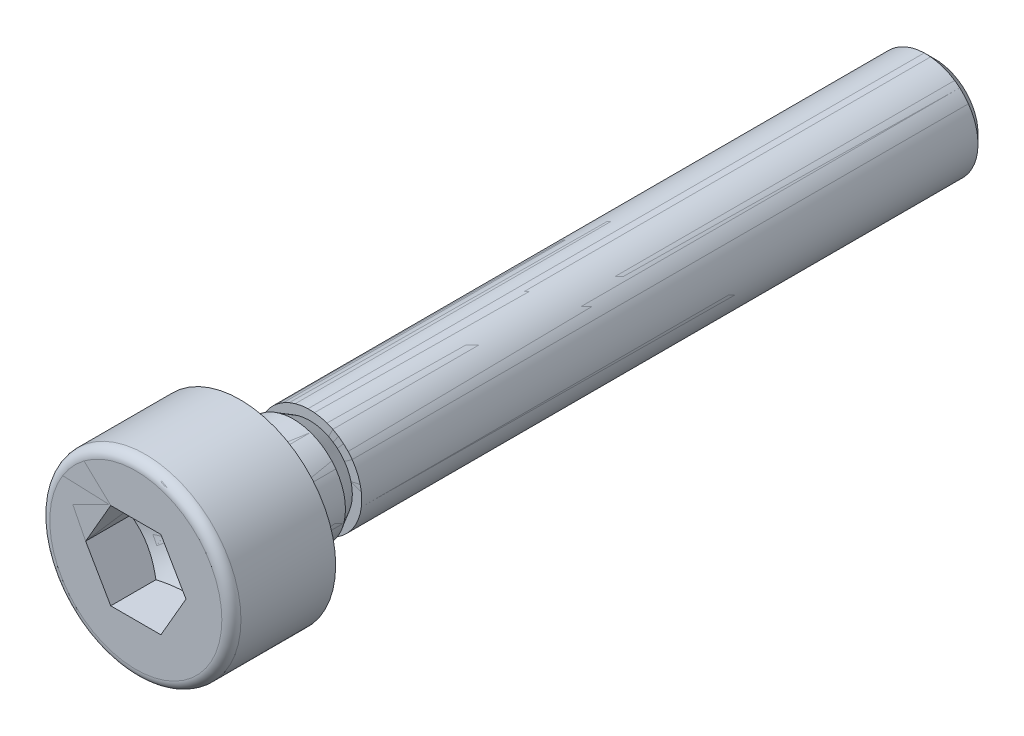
ISO-10303-21;
HEADER;
FILE_DESCRIPTION(('STEP AP214'),'2;1');
FILE_NAME('part.step','',(''),(''),'','','');
FILE_SCHEMA(('AUTOMOTIVE_DESIGN { 1 0 10303 214 1 1 1 1 }'));
ENDSEC;
DATA;
#1=APPLICATION_CONTEXT('core data for automotive mechanical design processes');
#2=APPLICATION_PROTOCOL_DEFINITION('international standard','automotive_design',2000,#1);
#3=PRODUCT_CONTEXT('',#1,'mechanical');
#4=PRODUCT('Part','Part','',(#3));
#5=PRODUCT_RELATED_PRODUCT_CATEGORY('part','',(#4));
#6=PRODUCT_DEFINITION_FORMATION('','',#4);
#7=PRODUCT_DEFINITION_CONTEXT('part definition',#1,'design');
#8=PRODUCT_DEFINITION('design','',#6,#7);
#9=PRODUCT_DEFINITION_SHAPE('','',#8);
#10=(LENGTH_UNIT() NAMED_UNIT(*) SI_UNIT(.MILLI.,.METRE.));
#11=(NAMED_UNIT(*) PLANE_ANGLE_UNIT() SI_UNIT($,.RADIAN.));
#12=(NAMED_UNIT(*) SI_UNIT($,.STERADIAN.) SOLID_ANGLE_UNIT());
#13=UNCERTAINTY_MEASURE_WITH_UNIT(LENGTH_MEASURE(1.E-05),#10,'distance_accuracy_value','');
#14=(GEOMETRIC_REPRESENTATION_CONTEXT(3) GLOBAL_UNCERTAINTY_ASSIGNED_CONTEXT((#13)) GLOBAL_UNIT_ASSIGNED_CONTEXT((#10,
#11,#12)) REPRESENTATION_CONTEXT('',''));
#15=CARTESIAN_POINT('',(0.,0.,0.));
#16=DIRECTION('',(0.,0.,1.));
#17=DIRECTION('',(1.,0.,0.));
#18=AXIS2_PLACEMENT_3D('',#15,#16,#17);
#19=CARTESIAN_POINT('',(0.,0.,3.00000000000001));
#20=DIRECTION('',(0.,0.,1.));
#21=DIRECTION('',(1.00000000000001,0.,0.));
#22=AXIS2_PLACEMENT_3D('',#19,#20,#21);
#23=PLANE('',#22);
#24=CARTESIAN_POINT('',(0.,0.,3.00000000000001));
#25=DIRECTION('',(0.,0.,1.));
#26=DIRECTION('',(1.00000000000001,0.,0.));
#27=AXIS2_PLACEMENT_3D('',#24,#25,#26);
#28=CIRCLE('',#27,2.475);
#29=CARTESIAN_POINT('',(2.47500000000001,0.,3.00000000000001));
#30=VERTEX_POINT('',#29);
#31=EDGE_CURVE('P0_E13',#30,#30,#28,.T.);
#32=ORIENTED_EDGE('',*,*,#31,.T.);
#33=EDGE_LOOP('',(#32));
#34=FACE_BOUND('',#33,.T.);
#35=DIRECTION('',(1.00000000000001,0.,0.));
#36=VECTOR('',#35,1.);
#37=CARTESIAN_POINT('',(-0.7216875,1.24999941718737,3.00000000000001));
#38=LINE('',#37,#36);
#39=CARTESIAN_POINT('',(-0.721687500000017,1.24999941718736,3.00000000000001));
#40=VERTEX_POINT('',#39);
#41=CARTESIAN_POINT('',(0.721687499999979,1.24999941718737,3.00000000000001));
#42=VERTEX_POINT('',#41);
#43=EDGE_CURVE('P0_E433',#40,#42,#38,.T.);
#44=ORIENTED_EDGE('',*,*,#43,.T.);
#45=DIRECTION('',(0.500000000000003,-0.866025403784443,0.));
#46=VECTOR('',#45,1.);
#47=CARTESIAN_POINT('',(0.721687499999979,1.24999941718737,3.00000000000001));
#48=LINE('',#47,#46);
#49=CARTESIAN_POINT('',(1.44337499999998,0.,3.00000000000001));
#50=VERTEX_POINT('',#49);
#51=EDGE_CURVE('P0_E372',#42,#50,#48,.T.);
#52=ORIENTED_EDGE('',*,*,#51,.T.);
#53=DIRECTION('',(-0.500000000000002,-0.866025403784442,0.));
#54=VECTOR('',#53,1.);
#55=CARTESIAN_POINT('',(1.44337499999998,0.,3.00000000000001));
#56=LINE('',#55,#54);
#57=CARTESIAN_POINT('',(0.721687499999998,-1.24999941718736,3.00000000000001));
#58=VERTEX_POINT('',#57);
#59=EDGE_CURVE('P0_E509',#50,#58,#56,.T.);
#60=ORIENTED_EDGE('',*,*,#59,.T.);
#61=DIRECTION('',(-1.00000000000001,0.,0.));
#62=VECTOR('',#61,1.);
#63=CARTESIAN_POINT('',(0.721687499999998,-1.24999941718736,3.00000000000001));
#64=LINE('',#63,#62);
#65=CARTESIAN_POINT('',(-0.721687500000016,-1.24999941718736,3.00000000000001));
#66=VERTEX_POINT('',#65);
#67=EDGE_CURVE('P0_E505',#58,#66,#64,.T.);
#68=ORIENTED_EDGE('',*,*,#67,.T.);
#69=DIRECTION('',(-0.500000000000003,0.866025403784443,0.));
#70=VECTOR('',#69,1.);
#71=CARTESIAN_POINT('',(-0.721687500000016,-1.24999941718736,3.00000000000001));
#72=LINE('',#71,#70);
#73=CARTESIAN_POINT('',(-1.44337500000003,0.,3.00000000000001));
#74=VERTEX_POINT('',#73);
#75=EDGE_CURVE('P0_E500',#66,#74,#72,.T.);
#76=ORIENTED_EDGE('',*,*,#75,.T.);
#77=DIRECTION('',(0.500000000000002,0.866025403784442,0.));
#78=VECTOR('',#77,1.);
#79=CARTESIAN_POINT('',(-1.44337500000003,0.,3.00000000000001));
#80=LINE('',#79,#78);
#81=EDGE_CURVE('P0_E437',#74,#40,#80,.T.);
#82=ORIENTED_EDGE('',*,*,#81,.T.);
#83=EDGE_LOOP('',(#44,#52,#60,#68,#76,#82));
#84=FACE_BOUND('',#83,.T.);
#85=ADVANCED_FACE('P0_F358',(#34,#84),#23,.T.);
#86=CARTESIAN_POINT('',(0.,0.,2.725));
#87=DIRECTION('',(0.,0.,1.));
#88=DIRECTION('',(1.00000000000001,0.,0.));
#89=AXIS2_PLACEMENT_3D('',#86,#87,#88);
#90=TOROIDAL_SURFACE('',#89,2.475,0.275);
#91=ORIENTED_EDGE('',*,*,#31,.F.);
#92=EDGE_LOOP('',(#91));
#93=FACE_BOUND('',#92,.T.);
#94=CARTESIAN_POINT('',(0.,0.,2.725));
#95=DIRECTION('',(0.,0.,1.));
#96=DIRECTION('',(1.00000000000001,0.,0.));
#97=AXIS2_PLACEMENT_3D('',#94,#95,#96);
#98=CIRCLE('',#97,2.75);
#99=CARTESIAN_POINT('',(2.75000000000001,0.,2.725));
#100=VERTEX_POINT('',#99);
#101=EDGE_CURVE('P0_E365',#100,#100,#98,.T.);
#102=ORIENTED_EDGE('',*,*,#101,.T.);
#103=EDGE_LOOP('',(#102));
#104=FACE_BOUND('',#103,.T.);
#105=ADVANCED_FACE('P0_F474',(#93,#104),#90,.T.);
#106=CARTESIAN_POINT('',(0.,0.,3.00000000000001));
#107=DIRECTION('',(0.,0.,1.));
#108=DIRECTION('',(1.00000000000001,0.,0.));
#109=AXIS2_PLACEMENT_3D('',#106,#107,#108);
#110=CYLINDRICAL_SURFACE('',#109,2.75);
#111=CARTESIAN_POINT('',(0.,0.,0.));
#112=DIRECTION('',(0.,0.,1.));
#113=DIRECTION('',(1.00000000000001,0.,0.));
#114=AXIS2_PLACEMENT_3D('',#111,#112,#113);
#115=CIRCLE('',#114,2.75);
#116=CARTESIAN_POINT('',(2.75000000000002,0.,0.));
#117=VERTEX_POINT('',#116);
#118=EDGE_CURVE('P0_E469',#117,#117,#115,.T.);
#119=ORIENTED_EDGE('',*,*,#118,.T.);
#120=EDGE_LOOP('',(#119));
#121=FACE_BOUND('',#120,.T.);
#122=ORIENTED_EDGE('',*,*,#101,.F.);
#123=EDGE_LOOP('',(#122));
#124=FACE_BOUND('',#123,.T.);
#125=ADVANCED_FACE('P0_F476',(#121,#124),#110,.T.);
#126=CARTESIAN_POINT('',(0.,2.75000000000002,0.));
#127=DIRECTION('',(0.,0.,-1.));
#128=DIRECTION('',(-1.00000000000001,0.,0.));
#129=AXIS2_PLACEMENT_3D('',#126,#127,#128);
#130=PLANE('',#129);
#131=CARTESIAN_POINT('',(0.,0.,0.));
#132=DIRECTION('',(0.,0.,1.));
#133=DIRECTION('',(1.00000000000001,0.,0.));
#134=AXIS2_PLACEMENT_3D('',#131,#132,#133);
#135=CIRCLE('',#134,1.65);
#136=CARTESIAN_POINT('',(1.65000000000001,0.,0.));
#137=VERTEX_POINT('',#136);
#138=EDGE_CURVE('P0_E466',#137,#137,#135,.T.);
#139=ORIENTED_EDGE('',*,*,#138,.T.);
#140=EDGE_LOOP('',(#139));
#141=FACE_BOUND('',#140,.T.);
#142=ORIENTED_EDGE('',*,*,#118,.F.);
#143=EDGE_LOOP('',(#142));
#144=FACE_BOUND('',#143,.T.);
#145=ADVANCED_FACE('P0_F478',(#141,#144),#130,.T.);
#146=CARTESIAN_POINT('',(0.,0.,-0.15));
#147=DIRECTION('',(0.,0.,1.));
#148=DIRECTION('',(1.00000000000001,0.,0.));
#149=AXIS2_PLACEMENT_3D('',#146,#147,#148);
#150=TOROIDAL_SURFACE('',#149,1.65,0.15);
#151=CARTESIAN_POINT('',(0.,0.,-0.15));
#152=DIRECTION('',(0.,0.,1.));
#153=DIRECTION('',(1.00000000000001,0.,0.));
#154=AXIS2_PLACEMENT_3D('',#151,#152,#153);
#155=CIRCLE('',#154,1.5);
#156=CARTESIAN_POINT('',(1.50000000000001,0.,-0.149999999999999));
#157=VERTEX_POINT('',#156);
#158=EDGE_CURVE('P0_E463',#157,#157,#155,.T.);
#159=ORIENTED_EDGE('',*,*,#158,.T.);
#160=EDGE_LOOP('',(#159));
#161=FACE_BOUND('',#160,.T.);
#162=ORIENTED_EDGE('',*,*,#138,.F.);
#163=EDGE_LOOP('',(#162));
#164=FACE_BOUND('',#163,.T.);
#165=ADVANCED_FACE('P0_F485',(#161,#164),#150,.F.);
#166=CARTESIAN_POINT('',(0.,0.,3.00000000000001));
#167=DIRECTION('',(0.,0.,1.));
#168=DIRECTION('',(1.00000000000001,0.,0.));
#169=AXIS2_PLACEMENT_3D('',#166,#167,#168);
#170=CYLINDRICAL_SURFACE('',#169,1.5);
#171=CARTESIAN_POINT('',(0.,0.,-1.53126375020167));
#172=DIRECTION('',(0.,0.,1.));
#173=DIRECTION('',(1.00000000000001,0.,0.));
#174=AXIS2_PLACEMENT_3D('',#171,#172,#173);
#175=CIRCLE('',#174,1.5);
#176=CARTESIAN_POINT('',(1.50000000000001,0.,-1.53126375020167));
#177=VERTEX_POINT('',#176);
#178=EDGE_CURVE('P0_E460',#177,#177,#175,.T.);
#179=ORIENTED_EDGE('',*,*,#178,.T.);
#180=EDGE_LOOP('',(#179));
#181=FACE_BOUND('',#180,.T.);
#182=ORIENTED_EDGE('',*,*,#158,.F.);
#183=EDGE_LOOP('',(#182));
#184=FACE_BOUND('',#183,.T.);
#185=ADVANCED_FACE('P0_F606',(#181,#184),#170,.T.);
#186=CARTESIAN_POINT('',(0.,0.,-1.53126375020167));
#187=DIRECTION('',(0.,0.,1.));
#188=DIRECTION('',(1.00000000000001,0.,0.));
#189=AXIS2_PLACEMENT_3D('',#186,#187,#188);
#190=CONICAL_SURFACE('',#189,1.5,0.523598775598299);
#191=CARTESIAN_POINT('',(0.,0.,-2.));
#192=DIRECTION('',(0.,0.,1.));
#193=DIRECTION('',(1.00000000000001,0.,0.));
#194=AXIS2_PLACEMENT_3D('',#191,#192,#193);
#195=CIRCLE('',#194,1.229375);
#196=CARTESIAN_POINT('',(1.22937500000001,0.,-2.));
#197=VERTEX_POINT('',#196);
#198=EDGE_CURVE('P0_E457',#197,#197,#195,.T.);
#199=ORIENTED_EDGE('',*,*,#198,.T.);
#200=EDGE_LOOP('',(#199));
#201=FACE_BOUND('',#200,.T.);
#202=ORIENTED_EDGE('',*,*,#178,.F.);
#203=EDGE_LOOP('',(#202));
#204=FACE_BOUND('',#203,.T.);
#205=ADVANCED_FACE('P0_F602',(#201,#204),#190,.T.);
#206=CARTESIAN_POINT('',(0.,1.229375,-2.));
#207=DIRECTION('',(0.,0.,1.));
#208=DIRECTION('',(1.00000000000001,0.,0.));
#209=AXIS2_PLACEMENT_3D('',#206,#207,#208);
#210=PLANE('',#209);
#211=CARTESIAN_POINT('',(0.,0.,-2.));
#212=DIRECTION('',(0.,0.,1.));
#213=DIRECTION('',(1.00000000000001,0.,0.));
#214=AXIS2_PLACEMENT_3D('',#211,#212,#213);
#215=CIRCLE('',#214,1.5);
#216=CARTESIAN_POINT('',(1.50000000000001,0.,-2.));
#217=VERTEX_POINT('',#216);
#218=EDGE_CURVE('P0_E454',#217,#217,#215,.T.);
#219=ORIENTED_EDGE('',*,*,#218,.T.);
#220=EDGE_LOOP('',(#219));
#221=FACE_BOUND('',#220,.T.);
#222=ORIENTED_EDGE('',*,*,#198,.F.);
#223=EDGE_LOOP('',(#222));
#224=FACE_BOUND('',#223,.T.);
#225=ADVANCED_FACE('P0_F598',(#221,#224),#210,.T.);
#226=CARTESIAN_POINT('',(0.,0.,3.00000000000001));
#227=DIRECTION('',(0.,0.,1.));
#228=DIRECTION('',(1.00000000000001,0.,0.));
#229=AXIS2_PLACEMENT_3D('',#226,#227,#228);
#230=CYLINDRICAL_SURFACE('',#229,1.5);
#231=CARTESIAN_POINT('',(0.,0.,-19.729375));
#232=DIRECTION('',(0.,0.,1.));
#233=DIRECTION('',(1.00000000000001,0.,0.));
#234=AXIS2_PLACEMENT_3D('',#231,#232,#233);
#235=CIRCLE('',#234,1.5);
#236=CARTESIAN_POINT('',(1.5,0.,-19.729375));
#237=VERTEX_POINT('',#236);
#238=EDGE_CURVE('P0_E451',#237,#237,#235,.T.);
#239=ORIENTED_EDGE('',*,*,#238,.T.);
#240=EDGE_LOOP('',(#239));
#241=FACE_BOUND('',#240,.T.);
#242=ORIENTED_EDGE('',*,*,#218,.F.);
#243=EDGE_LOOP('',(#242));
#244=FACE_BOUND('',#243,.T.);
#245=ADVANCED_FACE('P0_F591',(#241,#244),#230,.T.);
#246=CARTESIAN_POINT('',(0.,0.,-19.729375));
#247=DIRECTION('',(0.,0.,1.));
#248=DIRECTION('',(1.00000000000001,0.,0.));
#249=AXIS2_PLACEMENT_3D('',#246,#247,#248);
#250=CONICAL_SURFACE('',#249,1.5,0.78539816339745);
#251=CARTESIAN_POINT('',(0.,0.,-20.));
#252=DIRECTION('',(0.,0.,1.));
#253=DIRECTION('',(1.00000000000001,0.,0.));
#254=AXIS2_PLACEMENT_3D('',#251,#252,#253);
#255=CIRCLE('',#254,1.229375);
#256=CARTESIAN_POINT('',(1.229375,0.,-20.));
#257=VERTEX_POINT('',#256);
#258=EDGE_CURVE('P0_E448',#257,#257,#255,.T.);
#259=ORIENTED_EDGE('',*,*,#258,.T.);
#260=EDGE_LOOP('',(#259));
#261=FACE_BOUND('',#260,.T.);
#262=ORIENTED_EDGE('',*,*,#238,.F.);
#263=EDGE_LOOP('',(#262));
#264=FACE_BOUND('',#263,.T.);
#265=ADVANCED_FACE('P0_F586',(#261,#264),#250,.T.);
#266=CARTESIAN_POINT('',(0.,1.22937499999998,-20.));
#267=DIRECTION('',(0.,0.,-1.));
#268=DIRECTION('',(-1.00000000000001,0.,0.));
#269=AXIS2_PLACEMENT_3D('',#266,#267,#268);
#270=PLANE('',#269);
#271=ORIENTED_EDGE('',*,*,#258,.F.);
#272=EDGE_LOOP('',(#271));
#273=FACE_BOUND('',#272,.T.);
#274=ADVANCED_FACE('P0_F565',(#273),#270,.T.);
#275=CARTESIAN_POINT('',(0.721687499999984,1.24999941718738,0.866667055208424));
#276=DIRECTION('',(-0.866025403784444,-0.500000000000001,0.));
#277=DIRECTION('',(-0.500000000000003,0.866025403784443,0.));
#278=AXIS2_PLACEMENT_3D('',#275,#276,#277);
#279=PLANE('',#278);
#280=DIRECTION('',(0.,0.,1.));
#281=VECTOR('',#280,1.);
#282=CARTESIAN_POINT('',(1.44337499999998,0.,0.866667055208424));
#283=LINE('',#282,#281);
#284=CARTESIAN_POINT('',(1.44337499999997,0.,1.7));
#285=VERTEX_POINT('',#284);
#286=EDGE_CURVE('P0_E446',#285,#50,#283,.T.);
#287=ORIENTED_EDGE('',*,*,#286,.T.);
#288=ORIENTED_EDGE('',*,*,#51,.F.);
#289=DIRECTION('',(0.,0.,1.));
#290=VECTOR('',#289,1.);
#291=CARTESIAN_POINT('',(0.721687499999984,1.24999941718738,0.866667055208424));
#292=LINE('',#291,#290);
#293=CARTESIAN_POINT('',(0.721687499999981,1.24999941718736,1.7));
#294=VERTEX_POINT('',#293);
#295=EDGE_CURVE('P0_E427',#294,#42,#292,.T.);
#296=ORIENTED_EDGE('',*,*,#295,.F.);
#297=CARTESIAN_POINT('',(1.44337511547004,-2.00000008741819E-07,1.70000006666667));
#298=CARTESIAN_POINT('',(1.41166131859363,0.0549297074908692,1.68168478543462));
#299=CARTESIAN_POINT('',(1.37967376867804,0.110333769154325,1.66502799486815));
#300=CARTESIAN_POINT('',(1.31514482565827,0.222101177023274,1.63595406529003));
#301=CARTESIAN_POINT('',(1.28260228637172,0.278466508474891,1.62354721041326));
#302=CARTESIAN_POINT('',(1.21792049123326,0.390498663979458,1.60423504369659));
#303=CARTESIAN_POINT('',(1.18579118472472,0.446148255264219,1.59720118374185));
#304=CARTESIAN_POINT('',(1.12138147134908,0.557709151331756,1.58880578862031));
#305=CARTESIAN_POINT('',(1.0891012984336,0.613620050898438,1.58743729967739));
#306=CARTESIAN_POINT('',(1.02878924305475,0.718083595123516,1.5902914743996));
#307=CARTESIAN_POINT('',(1.00074831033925,0.766651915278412,1.59381334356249));
#308=CARTESIAN_POINT('',(0.944849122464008,0.863472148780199,1.60497335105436));
#309=CARTESIAN_POINT('',(0.916991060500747,0.91172372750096,1.61261529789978));
#310=CARTESIAN_POINT('',(0.860976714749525,1.0087434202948,1.63171868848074));
#311=CARTESIAN_POINT('',(0.832827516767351,1.05749926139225,1.64326107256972));
#312=CARTESIAN_POINT('',(0.776948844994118,1.15428395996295,1.66945740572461));
#313=CARTESIAN_POINT('',(0.749218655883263,1.20231405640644,1.68410520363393));
#314=CARTESIAN_POINT('',(0.721687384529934,1.24999961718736,1.70000006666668));
#315=B_SPLINE_CURVE_WITH_KNOTS('',3,(#297,#298,#299,#300,#301,#302,#303,#304,#305,#306,#307,
#308,#309,#310,#311,#312,#313,#314),.UNSPECIFIED.,.F.,.F.,(4,2,2,2,2,2,2,2,4),(0.,
0.198134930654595,0.396745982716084,0.590442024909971,0.783900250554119,0.95231708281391,
1.12088986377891,1.29320078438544,1.46517353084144),.UNSPECIFIED.);
#316=EDGE_CURVE('P0_E420',#285,#294,#315,.T.);
#317=ORIENTED_EDGE('',*,*,#316,.F.);
#318=EDGE_LOOP('',(#287,#288,#296,#317));
#319=FACE_BOUND('',#318,.T.);
#320=ADVANCED_FACE('P0_F428',(#319),#279,.T.);
#321=CARTESIAN_POINT('',(1.44337499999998,0.,0.866667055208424));
#322=DIRECTION('',(-0.866025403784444,0.500000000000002,0.));
#323=DIRECTION('',(0.500000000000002,0.866025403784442,0.));
#324=AXIS2_PLACEMENT_3D('',#321,#322,#323);
#325=PLANE('',#324);
#326=DIRECTION('',(0.,0.,1.));
#327=VECTOR('',#326,1.);
#328=CARTESIAN_POINT('',(0.721687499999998,-1.24999941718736,0.866667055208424));
#329=LINE('',#328,#327);
#330=CARTESIAN_POINT('',(0.721687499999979,-1.24999941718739,1.7));
#331=VERTEX_POINT('',#330);
#332=EDGE_CURVE('P0_E444',#331,#58,#329,.T.);
#333=ORIENTED_EDGE('',*,*,#332,.T.);
#334=ORIENTED_EDGE('',*,*,#59,.F.);
#335=ORIENTED_EDGE('',*,*,#286,.F.);
#336=CARTESIAN_POINT('',(0.721687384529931,-1.24999961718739,1.70000006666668));
#337=CARTESIAN_POINT('',(0.753401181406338,-1.19506970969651,1.68168478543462));
#338=CARTESIAN_POINT('',(0.785388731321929,-1.13966564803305,1.66502799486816));
#339=CARTESIAN_POINT('',(0.84991767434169,-1.0278982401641,1.63595406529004));
#340=CARTESIAN_POINT('',(0.882460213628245,-0.971532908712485,1.62354721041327));
#341=CARTESIAN_POINT('',(0.947142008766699,-0.85950075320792,1.60423504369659));
#342=CARTESIAN_POINT('',(0.979271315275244,-0.803851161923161,1.59720118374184));
#343=CARTESIAN_POINT('',(1.04368102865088,-0.69229026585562,1.58880578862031));
#344=CARTESIAN_POINT('',(1.07596120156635,-0.636379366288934,1.5874372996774));
#345=CARTESIAN_POINT('',(1.1362732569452,-0.531915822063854,1.5902914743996));
#346=CARTESIAN_POINT('',(1.16431418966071,-0.483347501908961,1.59381334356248));
#347=CARTESIAN_POINT('',(1.22021337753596,-0.386527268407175,1.60497335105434));
#348=CARTESIAN_POINT('',(1.24807143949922,-0.338275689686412,1.61261529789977));
#349=CARTESIAN_POINT('',(1.30408578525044,-0.241255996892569,1.63171868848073));
#350=CARTESIAN_POINT('',(1.33223498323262,-0.192500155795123,1.64326107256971));
#351=CARTESIAN_POINT('',(1.38811365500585,-0.0957154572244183,1.6694574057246));
#352=CARTESIAN_POINT('',(1.41584384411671,-0.0476853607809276,1.68410520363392));
#353=CARTESIAN_POINT('',(1.44337511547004,1.99999985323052E-07,1.70000006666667));
#354=B_SPLINE_CURVE_WITH_KNOTS('',3,(#336,#337,#338,#339,#340,#341,#342,#343,#344,#345,#346,
#347,#348,#349,#350,#351,#352,#353),.UNSPECIFIED.,.F.,.F.,(4,2,2,2,2,2,2,2,4),(0.,
0.198134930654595,0.396745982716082,0.590442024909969,0.783900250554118,0.952317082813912,
1.12088986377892,1.29320078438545,1.46517353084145),.UNSPECIFIED.);
#355=EDGE_CURVE('P0_E424',#331,#285,#354,.T.);
#356=ORIENTED_EDGE('',*,*,#355,.F.);
#357=EDGE_LOOP('',(#333,#334,#335,#356));
#358=FACE_BOUND('',#357,.T.);
#359=ADVANCED_FACE('P0_F556',(#358),#325,.T.);
#360=CARTESIAN_POINT('',(0.721687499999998,-1.24999941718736,0.866667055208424));
#361=DIRECTION('',(0.,1.,0.));
#362=DIRECTION('',(1.00000000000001,0.,0.));
#363=AXIS2_PLACEMENT_3D('',#360,#361,#362);
#364=PLANE('',#363);
#365=DIRECTION('',(0.,0.,1.));
#366=VECTOR('',#365,1.);
#367=CARTESIAN_POINT('',(-0.721687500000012,-1.24999941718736,0.866667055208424));
#368=LINE('',#367,#366);
#369=CARTESIAN_POINT('',(-0.721687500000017,-1.24999941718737,1.7));
#370=VERTEX_POINT('',#369);
#371=EDGE_CURVE('P0_E442',#370,#66,#368,.T.);
#372=ORIENTED_EDGE('',*,*,#371,.T.);
#373=ORIENTED_EDGE('',*,*,#67,.F.);
#374=ORIENTED_EDGE('',*,*,#332,.F.);
#375=CARTESIAN_POINT('',(-1.86893053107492,-1.24999941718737,2.16479389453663));
#376=CARTESIAN_POINT('',(-1.81495117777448,-1.24999941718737,2.13889663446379));
#377=CARTESIAN_POINT('',(-1.76084043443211,-1.24999941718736,2.11326843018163));
#378=CARTESIAN_POINT('',(-1.65228585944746,-1.24999941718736,2.06270259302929));
#379=CARTESIAN_POINT('',(-1.59784196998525,-1.24999941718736,2.03776508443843));
#380=CARTESIAN_POINT('',(-1.48823862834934,-1.24999941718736,1.98859378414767));
#381=CARTESIAN_POINT('',(-1.43307683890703,-1.24999941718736,1.96436517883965));
#382=CARTESIAN_POINT('',(-1.32229127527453,-1.24999941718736,1.9169949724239));
#383=CARTESIAN_POINT('',(-1.26666752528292,-1.24999941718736,1.89385331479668));
#384=CARTESIAN_POINT('',(-1.15340030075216,-1.24999941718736,1.84835454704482));
#385=CARTESIAN_POINT('',(-1.0957420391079,-1.24999941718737,1.82603375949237));
#386=CARTESIAN_POINT('',(-0.979740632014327,-1.24999941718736,1.78325544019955));
#387=CARTESIAN_POINT('',(-0.921397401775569,-1.24999941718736,1.76279814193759));
#388=CARTESIAN_POINT('',(-0.745435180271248,-1.24999941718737,1.70508423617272));
#389=CARTESIAN_POINT('',(-0.626561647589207,-1.24999941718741,1.67135022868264));
#390=CARTESIAN_POINT('',(-0.445872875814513,-1.24999941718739,1.63222043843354));
#391=CARTESIAN_POINT('',(-0.385304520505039,-1.24999941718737,1.62109409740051));
#392=CARTESIAN_POINT('',(-0.263486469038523,-1.24999941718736,1.6034278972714));
#393=CARTESIAN_POINT('',(-0.202236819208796,-1.24999941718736,1.59688772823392));
#394=CARTESIAN_POINT('',(-0.0801324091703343,-1.24999941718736,1.58899883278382));
#395=CARTESIAN_POINT('',(-0.0192817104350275,-1.24999941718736,1.58758884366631));
#396=CARTESIAN_POINT('',(0.102319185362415,-1.24999941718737,1.58991623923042));
#397=CARTESIAN_POINT('',(0.163069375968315,-1.24999941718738,1.59365394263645));
#398=CARTESIAN_POINT('',(0.312961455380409,-1.24999941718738,1.60889807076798));
#399=CARTESIAN_POINT('',(0.401812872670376,-1.24999941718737,1.62326128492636));
#400=CARTESIAN_POINT('',(0.577787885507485,-1.24999941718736,1.66029986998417));
#401=CARTESIAN_POINT('',(0.664909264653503,-1.24999941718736,1.68298525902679));
#402=CARTESIAN_POINT('',(0.795208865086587,-1.24999941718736,1.72173744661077));
#403=CARTESIAN_POINT('',(0.839060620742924,-1.24999941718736,1.73562293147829));
#404=CARTESIAN_POINT('',(0.926307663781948,-1.24999941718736,1.76467838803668));
#405=CARTESIAN_POINT('',(0.969703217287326,-1.24999941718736,1.77984755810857));
#406=CARTESIAN_POINT('',(1.05609584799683,-1.24999941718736,1.811250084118));
#407=CARTESIAN_POINT('',(1.09909299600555,-1.24999941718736,1.82748324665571));
#408=CARTESIAN_POINT('',(1.18474848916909,-1.24999941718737,1.86083816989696));
#409=CARTESIAN_POINT('',(1.227406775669,-1.24999941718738,1.87796008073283));
#410=CARTESIAN_POINT('',(1.33629337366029,-1.24999941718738,1.92276107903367));
#411=CARTESIAN_POINT('',(1.40230396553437,-1.24999941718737,1.95096875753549));
#412=CARTESIAN_POINT('',(1.53372905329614,-1.24999941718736,2.00874388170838));
#413=CARTESIAN_POINT('',(1.59914350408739,-1.24999941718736,2.03831142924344));
#414=CARTESIAN_POINT('',(1.79469127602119,-1.24999941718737,2.12857450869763));
#415=CARTESIAN_POINT('',(1.9241071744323,-1.24999941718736,2.19082122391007));
#416=CARTESIAN_POINT('',(2.18183332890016,-1.24999941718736,2.31792527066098));
#417=CARTESIAN_POINT('',(2.31014203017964,-1.24999941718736,2.38278571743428));
#418=CARTESIAN_POINT('',(2.56588033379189,-1.24999941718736,2.51417438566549));
#419=CARTESIAN_POINT('',(2.69331004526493,-1.24999941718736,2.58070239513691));
#420=CARTESIAN_POINT('',(2.9355621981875,-1.24999941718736,2.70857372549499));
#421=CARTESIAN_POINT('',(3.05043936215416,-1.24999941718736,2.76981373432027));
#422=CARTESIAN_POINT('',(3.27982416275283,-1.24999941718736,2.89299152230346));
#423=CARTESIAN_POINT('',(3.39433178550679,-1.24999941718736,2.95492932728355));
#424=CARTESIAN_POINT('',(3.62277143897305,-1.24999941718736,3.07916951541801));
#425=CARTESIAN_POINT('',(3.73670419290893,-1.24999941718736,3.14147057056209));
#426=CARTESIAN_POINT('',(3.96433935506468,-1.24999941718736,3.26647817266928));
#427=CARTESIAN_POINT('',(4.07804177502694,-1.24999941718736,3.32918469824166));
#428=CARTESIAN_POINT('',(4.19166144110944,-1.24999941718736,3.39203991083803));
#429=B_SPLINE_CURVE_WITH_KNOTS('',3,(#375,#376,#377,#378,#379,#380,#381,#382,#383,#384,#385,
#386,#387,#388,#389,#390,#391,#392,#393,#394,#395,#396,#397,#398,#399,#400,#401,#402,#403,#404,
#405,#406,#407,#408,#409,#410,#411,#412,#413,#414,#415,#416,#417,#418,#419,#420,#421,#422,#423,
#424,#425,#426,#427,#428),.UNSPECIFIED.,.F.,.F.,(4,2,2,2,2,2,2,2,2,2,2,2,2,2,2,2,2,2,2,2,2,2,2,
2,2,2,4),(0.,0.179612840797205,0.359257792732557,0.539992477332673,0.720717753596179,
0.906167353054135,1.09164015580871,1.46153946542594,1.64614477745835,1.83073761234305,
2.01311873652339,2.19551115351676,2.46497183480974,2.73475796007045,2.87273569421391,
3.01062789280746,3.14849509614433,3.28638566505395,3.50171814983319,3.71706679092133,
4.14783519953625,4.57913316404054,5.01037657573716,5.40091694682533,5.79147181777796,
6.18103330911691,6.57057441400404),.UNSPECIFIED.);
#430=EDGE_CURVE('P0_E547',#370,#331,#429,.T.);
#431=ORIENTED_EDGE('',*,*,#430,.F.);
#432=EDGE_LOOP('',(#372,#373,#374,#431));
#433=FACE_BOUND('',#432,.T.);
#434=ADVANCED_FACE('P0_F552',(#433),#364,.T.);
#435=CARTESIAN_POINT('',(-0.721687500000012,-1.24999941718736,0.866667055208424));
#436=DIRECTION('',(0.866025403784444,0.500000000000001,0.));
#437=DIRECTION('',(0.500000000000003,-0.866025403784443,0.));
#438=AXIS2_PLACEMENT_3D('',#435,#436,#437);
#439=PLANE('',#438);
#440=DIRECTION('',(0.,0.,1.));
#441=VECTOR('',#440,1.);
#442=CARTESIAN_POINT('',(-1.44337500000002,0.,0.866667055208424));
#443=LINE('',#442,#441);
#444=CARTESIAN_POINT('',(-1.44337500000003,0.,1.70000000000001));
#445=VERTEX_POINT('',#444);
#446=EDGE_CURVE('P0_E435',#445,#74,#443,.T.);
#447=ORIENTED_EDGE('',*,*,#446,.T.);
#448=ORIENTED_EDGE('',*,*,#75,.F.);
#449=ORIENTED_EDGE('',*,*,#371,.F.);
#450=CARTESIAN_POINT('',(-1.44337511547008,1.99999980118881E-07,1.70000006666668));
#451=CARTESIAN_POINT('',(-1.41166131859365,-0.0549297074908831,1.68168478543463));
#452=CARTESIAN_POINT('',(-1.37967376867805,-0.110333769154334,1.66502799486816));
#453=CARTESIAN_POINT('',(-1.31514482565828,-0.222101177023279,1.63595406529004));
#454=CARTESIAN_POINT('',(-1.28260228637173,-0.278466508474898,1.62354721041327));
#455=CARTESIAN_POINT('',(-1.21792049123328,-0.39049866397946,1.6042350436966));
#456=CARTESIAN_POINT('',(-1.18579118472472,-0.446148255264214,1.59720118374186));
#457=CARTESIAN_POINT('',(-1.12138147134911,-0.557709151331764,1.58880578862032));
#458=CARTESIAN_POINT('',(-1.08910129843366,-0.613620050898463,1.5874372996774));
#459=CARTESIAN_POINT('',(-1.02878924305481,-0.718083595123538,1.5902914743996));
#460=CARTESIAN_POINT('',(-1.00074831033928,-0.766651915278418,1.5938133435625));
#461=CARTESIAN_POINT('',(-0.944849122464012,-0.863472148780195,1.60497335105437));
#462=CARTESIAN_POINT('',(-0.916991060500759,-0.911723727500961,1.61261529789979));
#463=CARTESIAN_POINT('',(-0.860976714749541,-1.00874342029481,1.63171868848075));
#464=CARTESIAN_POINT('',(-0.832827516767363,-1.05749926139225,1.64326107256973));
#465=CARTESIAN_POINT('',(-0.77694884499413,-1.15428395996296,1.66945740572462));
#466=CARTESIAN_POINT('',(-0.749218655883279,-1.20231405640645,1.68410520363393));
#467=CARTESIAN_POINT('',(-0.721687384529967,-1.24999961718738,1.70000006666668));
#468=B_SPLINE_CURVE_WITH_KNOTS('',3,(#450,#451,#452,#453,#454,#455,#456,#457,#458,#459,#460,
#461,#462,#463,#464,#465,#466,#467),.UNSPECIFIED.,.F.,.F.,(4,2,2,2,2,2,2,2,4),(0.,
0.198134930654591,0.396745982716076,0.59044202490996,0.783900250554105,0.952317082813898,
1.12088986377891,1.29320078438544,1.46517353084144),.UNSPECIFIED.);
#469=EDGE_CURVE('P0_E542',#445,#370,#468,.T.);
#470=ORIENTED_EDGE('',*,*,#469,.F.);
#471=EDGE_LOOP('',(#447,#448,#449,#470));
#472=FACE_BOUND('',#471,.T.);
#473=ADVANCED_FACE('P0_F555',(#472),#439,.T.);
#474=CARTESIAN_POINT('',(-1.44337500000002,0.,0.866667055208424));
#475=DIRECTION('',(0.866025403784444,-0.500000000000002,0.));
#476=DIRECTION('',(-0.500000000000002,-0.866025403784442,0.));
#477=AXIS2_PLACEMENT_3D('',#474,#475,#476);
#478=PLANE('',#477);
#479=DIRECTION('',(0.,0.,1.));
#480=VECTOR('',#479,1.);
#481=CARTESIAN_POINT('',(-0.721687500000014,1.24999941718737,0.866667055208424));
#482=LINE('',#481,#480);
#483=CARTESIAN_POINT('',(-0.721687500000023,1.24999941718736,1.7));
#484=VERTEX_POINT('',#483);
#485=EDGE_CURVE('P0_E432',#484,#40,#482,.T.);
#486=ORIENTED_EDGE('',*,*,#485,.T.);
#487=ORIENTED_EDGE('',*,*,#81,.F.);
#488=ORIENTED_EDGE('',*,*,#446,.F.);
#489=CARTESIAN_POINT('',(-0.721687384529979,1.24999961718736,1.70000006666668));
#490=CARTESIAN_POINT('',(-0.753401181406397,1.19506970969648,1.68168478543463));
#491=CARTESIAN_POINT('',(-0.78538873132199,1.13966564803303,1.66502799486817));
#492=CARTESIAN_POINT('',(-0.849917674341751,1.02789824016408,1.63595406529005));
#493=CARTESIAN_POINT('',(-0.882460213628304,0.971532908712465,1.62354721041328));
#494=CARTESIAN_POINT('',(-0.94714200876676,0.859500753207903,1.60423504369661));
#495=CARTESIAN_POINT('',(-0.979271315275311,0.803851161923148,1.59720118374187));
#496=CARTESIAN_POINT('',(-1.04368102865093,0.692290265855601,1.58880578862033));
#497=CARTESIAN_POINT('',(-1.07596120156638,0.636379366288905,1.58743729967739));
#498=CARTESIAN_POINT('',(-1.13627325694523,0.531915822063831,1.5902914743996));
#499=CARTESIAN_POINT('',(-1.16431418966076,0.483347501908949,1.5938133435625));
#500=CARTESIAN_POINT('',(-1.22021337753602,0.386527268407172,1.60497335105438));
#501=CARTESIAN_POINT('',(-1.24807143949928,0.338275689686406,1.6126152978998));
#502=CARTESIAN_POINT('',(-1.30408578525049,0.24125599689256,1.63171868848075));
#503=CARTESIAN_POINT('',(-1.33223498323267,0.192500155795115,1.64326107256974));
#504=CARTESIAN_POINT('',(-1.38811365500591,0.0957154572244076,1.66945740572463));
#505=CARTESIAN_POINT('',(-1.41584384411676,0.0476853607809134,1.68410520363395));
#506=CARTESIAN_POINT('',(-1.44337511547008,-2.00000011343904E-07,1.70000006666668));
#507=B_SPLINE_CURVE_WITH_KNOTS('',3,(#489,#490,#491,#492,#493,#494,#495,#496,#497,#498,#499,
#500,#501,#502,#503,#504,#505,#506),.UNSPECIFIED.,.F.,.F.,(4,2,2,2,2,2,2,2,4),(0.,
0.198134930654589,0.396745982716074,0.590442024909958,0.7839002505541,0.952317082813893,
1.1208898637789,1.29320078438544,1.46517353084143),.UNSPECIFIED.);
#508=EDGE_CURVE('P0_E380',#484,#445,#507,.T.);
#509=ORIENTED_EDGE('',*,*,#508,.F.);
#510=EDGE_LOOP('',(#486,#487,#488,#509));
#511=FACE_BOUND('',#510,.T.);
#512=ADVANCED_FACE('P0_F499',(#511),#478,.T.);
#513=CARTESIAN_POINT('',(-0.721687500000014,1.24999941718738,0.866667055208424));
#514=DIRECTION('',(0.,-1.,0.));
#515=DIRECTION('',(-1.00000000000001,0.,0.));
#516=AXIS2_PLACEMENT_3D('',#513,#514,#515);
#517=PLANE('',#516);
#518=ORIENTED_EDGE('',*,*,#295,.T.);
#519=ORIENTED_EDGE('',*,*,#43,.F.);
#520=ORIENTED_EDGE('',*,*,#485,.F.);
#521=CARTESIAN_POINT('',(-1.86893053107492,1.24999941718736,2.16479389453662));
#522=CARTESIAN_POINT('',(-1.81495117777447,1.24999941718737,2.13889663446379));
#523=CARTESIAN_POINT('',(-1.7608404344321,1.24999941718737,2.11326843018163));
#524=CARTESIAN_POINT('',(-1.65228585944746,1.24999941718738,2.06270259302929));
#525=CARTESIAN_POINT('',(-1.59784196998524,1.24999941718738,2.03776508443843));
#526=CARTESIAN_POINT('',(-1.48823862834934,1.24999941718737,1.98859378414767));
#527=CARTESIAN_POINT('',(-1.43307683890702,1.24999941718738,1.96436517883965));
#528=CARTESIAN_POINT('',(-1.32229127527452,1.24999941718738,1.9169949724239));
#529=CARTESIAN_POINT('',(-1.26666752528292,1.24999941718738,1.89385331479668));
#530=CARTESIAN_POINT('',(-1.15340030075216,1.24999941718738,1.84835454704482));
#531=CARTESIAN_POINT('',(-1.09574203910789,1.24999941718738,1.82603375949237));
#532=CARTESIAN_POINT('',(-0.979740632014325,1.24999941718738,1.78325544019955));
#533=CARTESIAN_POINT('',(-0.921397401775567,1.24999941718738,1.76279814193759));
#534=CARTESIAN_POINT('',(-0.745435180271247,1.24999941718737,1.70508423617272));
#535=CARTESIAN_POINT('',(-0.626561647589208,1.24999941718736,1.67135022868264));
#536=CARTESIAN_POINT('',(-0.445872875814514,1.24999941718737,1.63222043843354));
#537=CARTESIAN_POINT('',(-0.385304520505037,1.24999941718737,1.62109409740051));
#538=CARTESIAN_POINT('',(-0.263486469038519,1.24999941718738,1.6034278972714));
#539=CARTESIAN_POINT('',(-0.20223681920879,1.24999941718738,1.59688772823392));
#540=CARTESIAN_POINT('',(-0.0801324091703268,1.24999941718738,1.58899883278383));
#541=CARTESIAN_POINT('',(-0.0192817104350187,1.24999941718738,1.58758884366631));
#542=CARTESIAN_POINT('',(0.102319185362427,1.24999941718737,1.58991623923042));
#543=CARTESIAN_POINT('',(0.163069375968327,1.24999941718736,1.59365394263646));
#544=CARTESIAN_POINT('',(0.312961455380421,1.24999941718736,1.60889807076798));
#545=CARTESIAN_POINT('',(0.401812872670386,1.24999941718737,1.62326128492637));
#546=CARTESIAN_POINT('',(0.577787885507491,1.24999941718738,1.66029986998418));
#547=CARTESIAN_POINT('',(0.664909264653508,1.24999941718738,1.6829852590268));
#548=CARTESIAN_POINT('',(0.795208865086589,1.24999941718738,1.72173744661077));
#549=CARTESIAN_POINT('',(0.839060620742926,1.24999941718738,1.73562293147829));
#550=CARTESIAN_POINT('',(0.926307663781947,1.24999941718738,1.76467838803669));
#551=CARTESIAN_POINT('',(0.969703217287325,1.24999941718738,1.77984755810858));
#552=CARTESIAN_POINT('',(1.05609584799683,1.24999941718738,1.811250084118));
#553=CARTESIAN_POINT('',(1.09909299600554,1.24999941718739,1.82748324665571));
#554=CARTESIAN_POINT('',(1.18474848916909,1.24999941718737,1.86083816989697));
#555=CARTESIAN_POINT('',(1.22740677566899,1.24999941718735,1.87796008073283));
#556=CARTESIAN_POINT('',(1.33629337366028,1.24999941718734,1.92276107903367));
#557=CARTESIAN_POINT('',(1.40230396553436,1.24999941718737,1.95096875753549));
#558=CARTESIAN_POINT('',(1.53372905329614,1.24999941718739,2.00874388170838));
#559=CARTESIAN_POINT('',(1.59914350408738,1.24999941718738,2.03831142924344));
#560=CARTESIAN_POINT('',(1.79469127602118,1.24999941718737,2.12857450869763));
#561=CARTESIAN_POINT('',(1.92410717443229,1.24999941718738,2.19082122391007));
#562=CARTESIAN_POINT('',(2.18183332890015,1.24999941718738,2.31792527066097));
#563=CARTESIAN_POINT('',(2.31014203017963,1.24999941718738,2.38278571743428));
#564=CARTESIAN_POINT('',(2.56588033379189,1.24999941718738,2.51417438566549));
#565=CARTESIAN_POINT('',(2.69331004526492,1.24999941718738,2.58070239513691));
#566=CARTESIAN_POINT('',(2.93556219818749,1.24999941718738,2.70857372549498));
#567=CARTESIAN_POINT('',(3.05043936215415,1.24999941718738,2.76981373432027));
#568=CARTESIAN_POINT('',(3.27982416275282,1.24999941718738,2.89299152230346));
#569=CARTESIAN_POINT('',(3.39433178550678,1.24999941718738,2.95492932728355));
#570=CARTESIAN_POINT('',(3.62277143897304,1.24999941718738,3.07916951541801));
#571=CARTESIAN_POINT('',(3.73670419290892,1.24999941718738,3.14147057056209));
#572=CARTESIAN_POINT('',(3.96433935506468,1.24999941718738,3.26647817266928));
#573=CARTESIAN_POINT('',(4.07804177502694,1.24999941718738,3.32918469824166));
#574=CARTESIAN_POINT('',(4.19166144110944,1.24999941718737,3.39203991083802));
#575=B_SPLINE_CURVE_WITH_KNOTS('',3,(#521,#522,#523,#524,#525,#526,#527,#528,#529,#530,#531,
#532,#533,#534,#535,#536,#537,#538,#539,#540,#541,#542,#543,#544,#545,#546,#547,#548,#549,#550,
#551,#552,#553,#554,#555,#556,#557,#558,#559,#560,#561,#562,#563,#564,#565,#566,#567,#568,#569,
#570,#571,#572,#573,#574),.UNSPECIFIED.,.F.,.F.,(4,2,2,2,2,2,2,2,2,2,2,2,2,2,2,2,2,2,2,2,2,2,2,
2,2,2,4),(0.,0.179612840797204,0.359257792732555,0.539992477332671,0.720717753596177,
0.906167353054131,1.0916401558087,1.46153946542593,1.64614477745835,1.83073761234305,
2.0131187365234,2.19551115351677,2.46497183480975,2.73475796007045,2.8727356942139,
3.01062789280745,3.14849509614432,3.28638566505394,3.50171814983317,3.71706679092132,
4.14783519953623,4.57913316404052,5.01037657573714,5.40091694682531,5.79147181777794,
6.18103330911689,6.57057441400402),.UNSPECIFIED.);
#576=EDGE_CURVE('P0_E421',#294,#484,#575,.F.);
#577=ORIENTED_EDGE('',*,*,#576,.F.);
#578=EDGE_LOOP('',(#518,#519,#520,#577));
#579=FACE_BOUND('',#578,.T.);
#580=ADVANCED_FACE('P0_F416',(#579),#517,.T.);
#581=CARTESIAN_POINT('',(0.,0.,0.866667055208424));
#582=DIRECTION('',(0.,0.,1.));
#583=DIRECTION('',(1.00000000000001,0.,0.));
#584=AXIS2_PLACEMENT_3D('',#581,#582,#583);
#585=CONICAL_SURFACE('',#584,0.,1.0471975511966);
#586=CARTESIAN_POINT('',(0.,0.,0.866667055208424));
#587=VERTEX_POINT('',#586);
#588=VERTEX_LOOP('',#587);
#589=FACE_BOUND('',#588,.T.);
#590=ORIENTED_EDGE('',*,*,#316,.T.);
#591=ORIENTED_EDGE('',*,*,#576,.T.);
#592=ORIENTED_EDGE('',*,*,#508,.T.);
#593=ORIENTED_EDGE('',*,*,#469,.T.);
#594=ORIENTED_EDGE('',*,*,#430,.T.);
#595=ORIENTED_EDGE('',*,*,#355,.T.);
#596=EDGE_LOOP('',(#590,#591,#592,#593,#594,#595));
#597=FACE_BOUND('',#596,.T.);
#598=ADVANCED_FACE('P0_F413',(#589,#597),#585,.F.);
#599=CLOSED_SHELL('',(#85,#105,#125,#145,#165,#185,#205,#225,#245,#265,#274,#320,#359,#434,#473,
#512,#580,#598));
#600=MANIFOLD_SOLID_BREP('P0_B2',#599);
#601=CARTESIAN_POINT('',(0.,0.,3.));
#602=DIRECTION('',(0.,0.,1.));
#603=DIRECTION('',(1.,0.,0.));
#604=AXIS2_PLACEMENT_3D('',#601,#602,#603);
#605=PLANE('',#604);
#606=CARTESIAN_POINT('',(0.,0.,3.));
#607=DIRECTION('',(0.,0.,1.));
#608=DIRECTION('',(1.,0.,0.));
#609=AXIS2_PLACEMENT_3D('',#606,#607,#608);
#610=CIRCLE('',#609,2.475);
#611=CARTESIAN_POINT('',(2.475,0.,3.));
#612=VERTEX_POINT('',#611);
#613=EDGE_CURVE('P1_E10',#612,#612,#610,.T.);
#614=ORIENTED_EDGE('',*,*,#613,.T.);
#615=EDGE_LOOP('',(#614));
#616=FACE_BOUND('',#615,.T.);
#617=DIRECTION('',(1.,0.,0.));
#618=VECTOR('',#617,1.);
#619=CARTESIAN_POINT('',(-0.721687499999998,1.24999941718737,3.));
#620=LINE('',#619,#618);
#621=CARTESIAN_POINT('',(-0.7216875,1.24999941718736,3.));
#622=VERTEX_POINT('',#621);
#623=CARTESIAN_POINT('',(0.721687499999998,1.24999941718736,3.));
#624=VERTEX_POINT('',#623);
#625=EDGE_CURVE('P1_E89',#622,#624,#620,.T.);
#626=ORIENTED_EDGE('',*,*,#625,.T.);
#627=DIRECTION('',(0.5,-0.866025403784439,0.));
#628=VECTOR('',#627,1.);
#629=CARTESIAN_POINT('',(0.721687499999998,1.24999941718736,3.));
#630=LINE('',#629,#628);
#631=CARTESIAN_POINT('',(1.443375,0.,3.));
#632=VERTEX_POINT('',#631);
#633=EDGE_CURVE('P1_E29',#624,#632,#630,.T.);
#634=ORIENTED_EDGE('',*,*,#633,.T.);
#635=DIRECTION('',(-0.5,-0.866025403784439,0.));
#636=VECTOR('',#635,1.);
#637=CARTESIAN_POINT('',(1.443375,0.,3.));
#638=LINE('',#637,#636);
#639=CARTESIAN_POINT('',(0.721687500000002,-1.24999941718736,3.));
#640=VERTEX_POINT('',#639);
#641=EDGE_CURVE('P1_E157',#632,#640,#638,.T.);
#642=ORIENTED_EDGE('',*,*,#641,.T.);
#643=DIRECTION('',(-1.,0.,0.));
#644=VECTOR('',#643,1.);
#645=CARTESIAN_POINT('',(0.721687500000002,-1.24999941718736,3.));
#646=LINE('',#645,#644);
#647=CARTESIAN_POINT('',(-0.721687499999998,-1.24999941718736,3.));
#648=VERTEX_POINT('',#647);
#649=EDGE_CURVE('P1_E153',#640,#648,#646,.T.);
#650=ORIENTED_EDGE('',*,*,#649,.T.);
#651=DIRECTION('',(-0.5,0.866025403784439,0.));
#652=VECTOR('',#651,1.);
#653=CARTESIAN_POINT('',(-0.721687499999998,-1.24999941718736,3.));
#654=LINE('',#653,#652);
#655=CARTESIAN_POINT('',(-1.443375,0.,3.));
#656=VERTEX_POINT('',#655);
#657=EDGE_CURVE('P1_E148',#648,#656,#654,.T.);
#658=ORIENTED_EDGE('',*,*,#657,.T.);
#659=DIRECTION('',(0.5,0.866025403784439,0.));
#660=VECTOR('',#659,1.);
#661=CARTESIAN_POINT('',(-1.443375,0.,3.));
#662=LINE('',#661,#660);
#663=EDGE_CURVE('P1_E93',#656,#622,#662,.T.);
#664=ORIENTED_EDGE('',*,*,#663,.T.);
#665=EDGE_LOOP('',(#626,#634,#642,#650,#658,#664));
#666=FACE_BOUND('',#665,.T.);
#667=ADVANCED_FACE('P1_F15',(#616,#666),#605,.T.);
#668=CARTESIAN_POINT('',(0.,0.,2.725));
#669=DIRECTION('',(0.,0.,1.));
#670=DIRECTION('',(1.,0.,0.));
#671=AXIS2_PLACEMENT_3D('',#668,#669,#670);
#672=TOROIDAL_SURFACE('',#671,2.475,0.275);
#673=ORIENTED_EDGE('',*,*,#613,.F.);
#674=EDGE_LOOP('',(#673));
#675=FACE_BOUND('',#674,.T.);
#676=CARTESIAN_POINT('',(0.,0.,2.725));
#677=DIRECTION('',(0.,0.,1.));
#678=DIRECTION('',(1.,0.,0.));
#679=AXIS2_PLACEMENT_3D('',#676,#677,#678);
#680=CIRCLE('',#679,2.75);
#681=CARTESIAN_POINT('',(2.75,0.,2.725));
#682=VERTEX_POINT('',#681);
#683=EDGE_CURVE('P1_E22',#682,#682,#680,.T.);
#684=ORIENTED_EDGE('',*,*,#683,.T.);
#685=EDGE_LOOP('',(#684));
#686=FACE_BOUND('',#685,.T.);
#687=ADVANCED_FACE('P1_F130',(#675,#686),#672,.T.);
#688=CARTESIAN_POINT('',(0.,0.,3.));
#689=DIRECTION('',(0.,0.,1.));
#690=DIRECTION('',(1.,0.,0.));
#691=AXIS2_PLACEMENT_3D('',#688,#689,#690);
#692=CYLINDRICAL_SURFACE('',#691,2.75);
#693=CARTESIAN_POINT('',(0.,0.,0.));
#694=DIRECTION('',(0.,0.,1.));
#695=DIRECTION('',(1.,0.,0.));
#696=AXIS2_PLACEMENT_3D('',#693,#694,#695);
#697=CIRCLE('',#696,2.75);
#698=CARTESIAN_POINT('',(2.75,0.,0.));
#699=VERTEX_POINT('',#698);
#700=EDGE_CURVE('P1_E125',#699,#699,#697,.T.);
#701=ORIENTED_EDGE('',*,*,#700,.T.);
#702=EDGE_LOOP('',(#701));
#703=FACE_BOUND('',#702,.T.);
#704=ORIENTED_EDGE('',*,*,#683,.F.);
#705=EDGE_LOOP('',(#704));
#706=FACE_BOUND('',#705,.T.);
#707=ADVANCED_FACE('P1_F132',(#703,#706),#692,.T.);
#708=CARTESIAN_POINT('',(0.,2.75,0.));
#709=DIRECTION('',(0.,0.,-1.));
#710=DIRECTION('',(-1.,0.,0.));
#711=AXIS2_PLACEMENT_3D('',#708,#709,#710);
#712=PLANE('',#711);
#713=CARTESIAN_POINT('',(0.,0.,0.));
#714=DIRECTION('',(0.,0.,1.));
#715=DIRECTION('',(1.,0.,0.));
#716=AXIS2_PLACEMENT_3D('',#713,#714,#715);
#717=CIRCLE('',#716,1.65);
#718=CARTESIAN_POINT('',(1.65,0.,0.));
#719=VERTEX_POINT('',#718);
#720=EDGE_CURVE('P1_E122',#719,#719,#717,.T.);
#721=ORIENTED_EDGE('',*,*,#720,.T.);
#722=EDGE_LOOP('',(#721));
#723=FACE_BOUND('',#722,.T.);
#724=ORIENTED_EDGE('',*,*,#700,.F.);
#725=EDGE_LOOP('',(#724));
#726=FACE_BOUND('',#725,.T.);
#727=ADVANCED_FACE('P1_F133',(#723,#726),#712,.T.);
#728=CARTESIAN_POINT('',(0.,0.,-0.15));
#729=DIRECTION('',(0.,0.,1.));
#730=DIRECTION('',(1.,0.,0.));
#731=AXIS2_PLACEMENT_3D('',#728,#729,#730);
#732=TOROIDAL_SURFACE('',#731,1.65,0.15);
#733=CARTESIAN_POINT('',(0.,0.,-0.15));
#734=DIRECTION('',(0.,0.,1.));
#735=DIRECTION('',(1.,0.,0.));
#736=AXIS2_PLACEMENT_3D('',#733,#734,#735);
#737=CIRCLE('',#736,1.5);
#738=CARTESIAN_POINT('',(1.5,0.,-0.15));
#739=VERTEX_POINT('',#738);
#740=EDGE_CURVE('P1_E119',#739,#739,#737,.T.);
#741=ORIENTED_EDGE('',*,*,#740,.T.);
#742=EDGE_LOOP('',(#741));
#743=FACE_BOUND('',#742,.T.);
#744=ORIENTED_EDGE('',*,*,#720,.F.);
#745=EDGE_LOOP('',(#744));
#746=FACE_BOUND('',#745,.T.);
#747=ADVANCED_FACE('P1_F136',(#743,#746),#732,.F.);
#748=CARTESIAN_POINT('',(0.,0.,3.));
#749=DIRECTION('',(0.,0.,1.));
#750=DIRECTION('',(1.,0.,0.));
#751=AXIS2_PLACEMENT_3D('',#748,#749,#750);
#752=CYLINDRICAL_SURFACE('',#751,1.5);
#753=CARTESIAN_POINT('',(0.,0.,-1.53126375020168));
#754=DIRECTION('',(0.,0.,1.));
#755=DIRECTION('',(1.,0.,0.));
#756=AXIS2_PLACEMENT_3D('',#753,#754,#755);
#757=CIRCLE('',#756,1.5);
#758=CARTESIAN_POINT('',(1.5,0.,-1.53126375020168));
#759=VERTEX_POINT('',#758);
#760=EDGE_CURVE('P1_E116',#759,#759,#757,.T.);
#761=ORIENTED_EDGE('',*,*,#760,.T.);
#762=EDGE_LOOP('',(#761));
#763=FACE_BOUND('',#762,.T.);
#764=ORIENTED_EDGE('',*,*,#740,.F.);
#765=EDGE_LOOP('',(#764));
#766=FACE_BOUND('',#765,.T.);
#767=ADVANCED_FACE('P1_F227',(#763,#766),#752,.T.);
#768=CARTESIAN_POINT('',(0.,0.,-1.53126375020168));
#769=DIRECTION('',(0.,0.,1.));
#770=DIRECTION('',(1.,0.,0.));
#771=AXIS2_PLACEMENT_3D('',#768,#769,#770);
#772=CONICAL_SURFACE('',#771,1.5,0.523598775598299);
#773=CARTESIAN_POINT('',(0.,0.,-2.));
#774=DIRECTION('',(0.,0.,1.));
#775=DIRECTION('',(1.,0.,0.));
#776=AXIS2_PLACEMENT_3D('',#773,#774,#775);
#777=CIRCLE('',#776,1.229375);
#778=CARTESIAN_POINT('',(1.229375,0.,-2.));
#779=VERTEX_POINT('',#778);
#780=EDGE_CURVE('P1_E113',#779,#779,#777,.T.);
#781=ORIENTED_EDGE('',*,*,#780,.T.);
#782=EDGE_LOOP('',(#781));
#783=FACE_BOUND('',#782,.T.);
#784=ORIENTED_EDGE('',*,*,#760,.F.);
#785=EDGE_LOOP('',(#784));
#786=FACE_BOUND('',#785,.T.);
#787=ADVANCED_FACE('P1_F224',(#783,#786),#772,.T.);
#788=CARTESIAN_POINT('',(0.,1.229375,-2.));
#789=DIRECTION('',(0.,0.,1.));
#790=DIRECTION('',(1.,0.,0.));
#791=AXIS2_PLACEMENT_3D('',#788,#789,#790);
#792=PLANE('',#791);
#793=CARTESIAN_POINT('',(0.,0.,-2.));
#794=DIRECTION('',(0.,0.,1.));
#795=DIRECTION('',(1.,0.,0.));
#796=AXIS2_PLACEMENT_3D('',#793,#794,#795);
#797=CIRCLE('',#796,1.5);
#798=CARTESIAN_POINT('',(1.5,0.,-2.));
#799=VERTEX_POINT('',#798);
#800=EDGE_CURVE('P1_E110',#799,#799,#797,.T.);
#801=ORIENTED_EDGE('',*,*,#800,.T.);
#802=EDGE_LOOP('',(#801));
#803=FACE_BOUND('',#802,.T.);
#804=ORIENTED_EDGE('',*,*,#780,.F.);
#805=EDGE_LOOP('',(#804));
#806=FACE_BOUND('',#805,.T.);
#807=ADVANCED_FACE('P1_F221',(#803,#806),#792,.T.);
#808=CARTESIAN_POINT('',(0.,0.,3.));
#809=DIRECTION('',(0.,0.,1.));
#810=DIRECTION('',(1.,0.,0.));
#811=AXIS2_PLACEMENT_3D('',#808,#809,#810);
#812=CYLINDRICAL_SURFACE('',#811,1.5);
#813=CARTESIAN_POINT('',(0.,0.,-19.729375));
#814=DIRECTION('',(0.,0.,1.));
#815=DIRECTION('',(1.,0.,0.));
#816=AXIS2_PLACEMENT_3D('',#813,#814,#815);
#817=CIRCLE('',#816,1.5);
#818=CARTESIAN_POINT('',(1.5,0.,-19.729375));
#819=VERTEX_POINT('',#818);
#820=EDGE_CURVE('P1_E107',#819,#819,#817,.T.);
#821=ORIENTED_EDGE('',*,*,#820,.T.);
#822=EDGE_LOOP('',(#821));
#823=FACE_BOUND('',#822,.T.);
#824=ORIENTED_EDGE('',*,*,#800,.F.);
#825=EDGE_LOOP('',(#824));
#826=FACE_BOUND('',#825,.T.);
#827=ADVANCED_FACE('P1_F215',(#823,#826),#812,.T.);
#828=CARTESIAN_POINT('',(0.,0.,-19.729375));
#829=DIRECTION('',(0.,0.,1.));
#830=DIRECTION('',(1.,0.,0.));
#831=AXIS2_PLACEMENT_3D('',#828,#829,#830);
#832=CONICAL_SURFACE('',#831,1.5,0.78539816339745);
#833=CARTESIAN_POINT('',(0.,0.,-20.));
#834=DIRECTION('',(0.,0.,1.));
#835=DIRECTION('',(1.,0.,0.));
#836=AXIS2_PLACEMENT_3D('',#833,#834,#835);
#837=CIRCLE('',#836,1.229375);
#838=CARTESIAN_POINT('',(1.229375,0.,-20.));
#839=VERTEX_POINT('',#838);
#840=EDGE_CURVE('P1_E104',#839,#839,#837,.T.);
#841=ORIENTED_EDGE('',*,*,#840,.T.);
#842=EDGE_LOOP('',(#841));
#843=FACE_BOUND('',#842,.T.);
#844=ORIENTED_EDGE('',*,*,#820,.F.);
#845=EDGE_LOOP('',(#844));
#846=FACE_BOUND('',#845,.T.);
#847=ADVANCED_FACE('P1_F213',(#843,#846),#832,.T.);
#848=CARTESIAN_POINT('',(0.,1.229375,-20.));
#849=DIRECTION('',(0.,0.,-1.));
#850=DIRECTION('',(-1.,0.,0.));
#851=AXIS2_PLACEMENT_3D('',#848,#849,#850);
#852=PLANE('',#851);
#853=ORIENTED_EDGE('',*,*,#840,.F.);
#854=EDGE_LOOP('',(#853));
#855=FACE_BOUND('',#854,.T.);
#856=ADVANCED_FACE('P1_F208',(#855),#852,.T.);
#857=CARTESIAN_POINT('',(0.721687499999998,1.24999941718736,0.866667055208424));
#858=DIRECTION('',(-0.866025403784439,-0.5,0.));
#859=DIRECTION('',(-0.5,0.866025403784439,0.));
#860=AXIS2_PLACEMENT_3D('',#857,#858,#859);
#861=PLANE('',#860);
#862=DIRECTION('',(0.,0.,1.));
#863=VECTOR('',#862,1.);
#864=CARTESIAN_POINT('',(1.443375,0.,0.866667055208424));
#865=LINE('',#864,#863);
#866=CARTESIAN_POINT('',(1.443375,0.,1.7));
#867=VERTEX_POINT('',#866);
#868=EDGE_CURVE('P1_E102',#867,#632,#865,.T.);
#869=ORIENTED_EDGE('',*,*,#868,.T.);
#870=ORIENTED_EDGE('',*,*,#633,.F.);
#871=DIRECTION('',(0.,0.,1.));
#872=VECTOR('',#871,1.);
#873=CARTESIAN_POINT('',(0.721687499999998,1.24999941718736,0.866667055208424));
#874=LINE('',#873,#872);
#875=CARTESIAN_POINT('',(0.721687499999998,1.24999941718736,1.7));
#876=VERTEX_POINT('',#875);
#877=EDGE_CURVE('P1_E83',#876,#624,#874,.T.);
#878=ORIENTED_EDGE('',*,*,#877,.F.);
#879=CARTESIAN_POINT('',(1.44337511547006,-1.99999998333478E-07,1.70000006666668));
#880=CARTESIAN_POINT('',(1.41166131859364,0.0549297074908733,1.68168478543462));
#881=CARTESIAN_POINT('',(1.37967376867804,0.110333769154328,1.66502799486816));
#882=CARTESIAN_POINT('',(1.31514482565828,0.222101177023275,1.63595406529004));
#883=CARTESIAN_POINT('',(1.28260228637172,0.278466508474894,1.62354721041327));
#884=CARTESIAN_POINT('',(1.21792049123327,0.390498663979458,1.6042350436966));
#885=CARTESIAN_POINT('',(1.18579118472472,0.446148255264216,1.59720118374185));
#886=CARTESIAN_POINT('',(1.12138147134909,0.55770915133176,1.58880578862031));
#887=CARTESIAN_POINT('',(1.08910129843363,0.613620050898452,1.58743729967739));
#888=CARTESIAN_POINT('',(1.02878924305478,0.718083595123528,1.59029147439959));
#889=CARTESIAN_POINT('',(1.00074831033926,0.766651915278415,1.59381334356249));
#890=CARTESIAN_POINT('',(0.944849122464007,0.863472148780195,1.60497335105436));
#891=CARTESIAN_POINT('',(0.916991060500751,0.911723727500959,1.61261529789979));
#892=CARTESIAN_POINT('',(0.860976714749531,1.0087434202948,1.63171868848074));
#893=CARTESIAN_POINT('',(0.832827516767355,1.05749926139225,1.64326107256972));
#894=CARTESIAN_POINT('',(0.776948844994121,1.15428395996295,1.66945740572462));
#895=CARTESIAN_POINT('',(0.749218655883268,1.20231405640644,1.68410520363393));
#896=CARTESIAN_POINT('',(0.721687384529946,1.24999961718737,1.70000006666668));
#897=B_SPLINE_CURVE_WITH_KNOTS('',3,(#879,#880,#881,#882,#883,#884,#885,#886,#887,#888,#889,
#890,#891,#892,#893,#894,#895,#896),.UNSPECIFIED.,.F.,.F.,(4,2,2,2,2,2,2,2,4),(0.,
0.198134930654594,0.396745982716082,0.590442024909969,0.783900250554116,0.952317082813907,
1.12088986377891,1.29320078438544,1.46517353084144),.UNSPECIFIED.);
#898=EDGE_CURVE('P1_E76',#867,#876,#897,.T.);
#899=ORIENTED_EDGE('',*,*,#898,.F.);
#900=EDGE_LOOP('',(#869,#870,#878,#899));
#901=FACE_BOUND('',#900,.T.);
#902=ADVANCED_FACE('P1_F84',(#901),#861,.T.);
#903=CARTESIAN_POINT('',(1.443375,0.,0.866667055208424));
#904=DIRECTION('',(-0.866025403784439,0.5,0.));
#905=DIRECTION('',(0.5,0.866025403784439,0.));
#906=AXIS2_PLACEMENT_3D('',#903,#904,#905);
#907=PLANE('',#906);
#908=DIRECTION('',(0.,0.,1.));
#909=VECTOR('',#908,1.);
#910=CARTESIAN_POINT('',(0.721687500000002,-1.24999941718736,0.866667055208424));
#911=LINE('',#910,#909);
#912=CARTESIAN_POINT('',(0.721687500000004,-1.24999941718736,1.7));
#913=VERTEX_POINT('',#912);
#914=EDGE_CURVE('P1_E100',#913,#640,#911,.T.);
#915=ORIENTED_EDGE('',*,*,#914,.T.);
#916=ORIENTED_EDGE('',*,*,#641,.F.);
#917=ORIENTED_EDGE('',*,*,#868,.F.);
#918=CARTESIAN_POINT('',(0.72168738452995,-1.24999961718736,1.70000006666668));
#919=CARTESIAN_POINT('',(0.753401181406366,-1.19506970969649,1.68168478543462));
#920=CARTESIAN_POINT('',(0.78538873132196,-1.13966564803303,1.66502799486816));
#921=CARTESIAN_POINT('',(0.849917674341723,-1.02789824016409,1.63595406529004));
#922=CARTESIAN_POINT('',(0.882460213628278,-0.971532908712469,1.62354721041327));
#923=CARTESIAN_POINT('',(0.947142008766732,-0.859500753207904,1.6042350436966));
#924=CARTESIAN_POINT('',(0.97927131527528,-0.803851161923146,1.59720118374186));
#925=CARTESIAN_POINT('',(1.04368102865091,-0.692290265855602,1.58880578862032));
#926=CARTESIAN_POINT('',(1.07596120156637,-0.636379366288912,1.58743729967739));
#927=CARTESIAN_POINT('',(1.13627325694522,-0.531915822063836,1.59029147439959));
#928=CARTESIAN_POINT('',(1.16431418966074,-0.483347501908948,1.59381334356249));
#929=CARTESIAN_POINT('',(1.22021337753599,-0.386527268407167,1.60497335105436));
#930=CARTESIAN_POINT('',(1.24807143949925,-0.338275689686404,1.61261529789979));
#931=CARTESIAN_POINT('',(1.30408578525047,-0.241255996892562,1.63171868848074));
#932=CARTESIAN_POINT('',(1.33223498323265,-0.192500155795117,1.64326107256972));
#933=CARTESIAN_POINT('',(1.38811365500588,-0.095715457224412,1.66945740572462));
#934=CARTESIAN_POINT('',(1.41584384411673,-0.0476853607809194,1.68410520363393));
#935=CARTESIAN_POINT('',(1.44337511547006,2.00000000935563E-07,1.70000006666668));
#936=B_SPLINE_CURVE_WITH_KNOTS('',3,(#918,#919,#920,#921,#922,#923,#924,#925,#926,#927,#928,
#929,#930,#931,#932,#933,#934,#935),.UNSPECIFIED.,.F.,.F.,(4,2,2,2,2,2,2,2,4),(0.,
0.198134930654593,0.396745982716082,0.590442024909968,0.783900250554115,0.952317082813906,
1.12088986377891,1.29320078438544,1.46517353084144),.UNSPECIFIED.);
#937=EDGE_CURVE('P1_E80',#913,#867,#936,.T.);
#938=ORIENTED_EDGE('',*,*,#937,.F.);
#939=EDGE_LOOP('',(#915,#916,#917,#938));
#940=FACE_BOUND('',#939,.T.);
#941=ADVANCED_FACE('P1_F203',(#940),#907,.T.);
#942=CARTESIAN_POINT('',(0.721687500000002,-1.24999941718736,0.866667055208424));
#943=DIRECTION('',(0.,1.,0.));
#944=DIRECTION('',(1.,0.,0.));
#945=AXIS2_PLACEMENT_3D('',#942,#943,#944);
#946=PLANE('',#945);
#947=DIRECTION('',(0.,0.,1.));
#948=VECTOR('',#947,1.);
#949=CARTESIAN_POINT('',(-0.721687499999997,-1.24999941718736,0.866667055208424));
#950=LINE('',#949,#948);
#951=CARTESIAN_POINT('',(-0.721687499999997,-1.24999941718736,1.7));
#952=VERTEX_POINT('',#951);
#953=EDGE_CURVE('P1_E98',#952,#648,#950,.T.);
#954=ORIENTED_EDGE('',*,*,#953,.T.);
#955=ORIENTED_EDGE('',*,*,#649,.F.);
#956=ORIENTED_EDGE('',*,*,#914,.F.);
#957=CARTESIAN_POINT('',(-1.86893053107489,-1.24999941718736,2.16479389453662));
#958=CARTESIAN_POINT('',(-1.81495117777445,-1.24999941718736,2.13889663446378));
#959=CARTESIAN_POINT('',(-1.76084043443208,-1.24999941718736,2.11326843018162));
#960=CARTESIAN_POINT('',(-1.65228585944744,-1.24999941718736,2.06270259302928));
#961=CARTESIAN_POINT('',(-1.59784196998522,-1.24999941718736,2.03776508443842));
#962=CARTESIAN_POINT('',(-1.48823862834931,-1.24999941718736,1.98859378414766));
#963=CARTESIAN_POINT('',(-1.433076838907,-1.24999941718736,1.96436517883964));
#964=CARTESIAN_POINT('',(-1.3222912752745,-1.24999941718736,1.91699497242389));
#965=CARTESIAN_POINT('',(-1.2666675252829,-1.24999941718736,1.89385331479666));
#966=CARTESIAN_POINT('',(-1.15340030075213,-1.24999941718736,1.84835454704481));
#967=CARTESIAN_POINT('',(-1.09574203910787,-1.24999941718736,1.82603375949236));
#968=CARTESIAN_POINT('',(-0.9797406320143,-1.24999941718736,1.78325544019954));
#969=CARTESIAN_POINT('',(-0.921397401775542,-1.24999941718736,1.76279814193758));
#970=CARTESIAN_POINT('',(-0.74543518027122,-1.24999941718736,1.70508423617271));
#971=CARTESIAN_POINT('',(-0.626561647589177,-1.24999941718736,1.67135022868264));
#972=CARTESIAN_POINT('',(-0.445872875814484,-1.24999941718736,1.63222043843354));
#973=CARTESIAN_POINT('',(-0.38530452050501,-1.24999941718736,1.6210940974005));
#974=CARTESIAN_POINT('',(-0.263486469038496,-1.24999941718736,1.60342789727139));
#975=CARTESIAN_POINT('',(-0.202236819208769,-1.24999941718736,1.59688772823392));
#976=CARTESIAN_POINT('',(-0.0801324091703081,-1.24999941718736,1.58899883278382));
#977=CARTESIAN_POINT('',(-0.0192817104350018,-1.24999941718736,1.58758884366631));
#978=CARTESIAN_POINT('',(0.10231918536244,-1.24999941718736,1.58991623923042));
#979=CARTESIAN_POINT('',(0.163069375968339,-1.24999941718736,1.59365394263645));
#980=CARTESIAN_POINT('',(0.312961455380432,-1.24999941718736,1.60889807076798));
#981=CARTESIAN_POINT('',(0.401812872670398,-1.24999941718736,1.62326128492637));
#982=CARTESIAN_POINT('',(0.577787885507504,-1.24999941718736,1.66029986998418));
#983=CARTESIAN_POINT('',(0.664909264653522,-1.24999941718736,1.68298525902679));
#984=CARTESIAN_POINT('',(0.795208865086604,-1.24999941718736,1.72173744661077));
#985=CARTESIAN_POINT('',(0.83906062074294,-1.24999941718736,1.73562293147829));
#986=CARTESIAN_POINT('',(0.926307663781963,-1.24999941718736,1.76467838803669));
#987=CARTESIAN_POINT('',(0.969703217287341,-1.24999941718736,1.77984755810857));
#988=CARTESIAN_POINT('',(1.05609584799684,-1.24999941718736,1.811250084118));
#989=CARTESIAN_POINT('',(1.09909299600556,-1.24999941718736,1.82748324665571));
#990=CARTESIAN_POINT('',(1.1847484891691,-1.24999941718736,1.86083816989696));
#991=CARTESIAN_POINT('',(1.22740677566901,-1.24999941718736,1.87796008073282));
#992=CARTESIAN_POINT('',(1.3362933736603,-1.24999941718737,1.92276107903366));
#993=CARTESIAN_POINT('',(1.40230396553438,-1.24999941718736,1.95096875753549));
#994=CARTESIAN_POINT('',(1.53372905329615,-1.24999941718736,2.00874388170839));
#995=CARTESIAN_POINT('',(1.59914350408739,-1.24999941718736,2.03831142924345));
#996=CARTESIAN_POINT('',(1.79469127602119,-1.24999941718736,2.12857450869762));
#997=CARTESIAN_POINT('',(1.9241071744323,-1.24999941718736,2.19082122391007));
#998=CARTESIAN_POINT('',(2.18183332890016,-1.24999941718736,2.31792527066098));
#999=CARTESIAN_POINT('',(2.31014203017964,-1.24999941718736,2.38278571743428));
#1000=CARTESIAN_POINT('',(2.56588033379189,-1.24999941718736,2.51417438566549));
#1001=CARTESIAN_POINT('',(2.69331004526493,-1.24999941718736,2.58070239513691));
#1002=CARTESIAN_POINT('',(2.93556219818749,-1.24999941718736,2.70857372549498));
#1003=CARTESIAN_POINT('',(3.05043936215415,-1.24999941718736,2.76981373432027));
#1004=CARTESIAN_POINT('',(3.27982416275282,-1.24999941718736,2.89299152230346));
#1005=CARTESIAN_POINT('',(3.39433178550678,-1.24999941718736,2.95492932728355));
#1006=CARTESIAN_POINT('',(3.62277143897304,-1.24999941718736,3.07916951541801));
#1007=CARTESIAN_POINT('',(3.73670419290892,-1.24999941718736,3.14147057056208));
#1008=CARTESIAN_POINT('',(3.96433935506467,-1.24999941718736,3.26647817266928));
#1009=CARTESIAN_POINT('',(4.07804177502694,-1.24999941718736,3.32918469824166));
#1010=CARTESIAN_POINT('',(4.19166144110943,-1.24999941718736,3.39203991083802));
#1011=B_SPLINE_CURVE_WITH_KNOTS('',3,(#957,#958,#959,#960,#961,#962,#963,#964,#965,#966,#967,
#968,#969,#970,#971,#972,#973,#974,#975,#976,#977,#978,#979,#980,#981,#982,#983,#984,#985,#986,
#987,#988,#989,#990,#991,#992,#993,#994,#995,#996,#997,#998,#999,#1000,#1001,#1002,#1003,#1004,
#1005,#1006,#1007,#1008,#1009,#1010),.UNSPECIFIED.,.F.,.F.,(4,2,2,2,2,2,2,2,2,2,2,2,2,2,2,2,2,2,
2,2,2,2,2,2,2,2,4),(0.,0.179612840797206,0.359257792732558,0.539992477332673,0.72071775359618,
0.906167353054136,1.09164015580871,1.46153946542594,1.64614477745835,1.83073761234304,
2.01311873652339,2.19551115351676,2.46497183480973,2.73475796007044,2.8727356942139,
3.01062789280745,3.14849509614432,3.28638566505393,3.50171814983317,3.71706679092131,
4.14783519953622,4.57913316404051,5.01037657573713,5.40091694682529,5.79147181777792,
6.18103330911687,6.570574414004),.UNSPECIFIED.);
#1012=EDGE_CURVE('P1_E195',#952,#913,#1011,.T.);
#1013=ORIENTED_EDGE('',*,*,#1012,.F.);
#1014=EDGE_LOOP('',(#954,#955,#956,#1013));
#1015=FACE_BOUND('',#1014,.T.);
#1016=ADVANCED_FACE('P1_F200',(#1015),#946,.T.);
#1017=CARTESIAN_POINT('',(-0.721687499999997,-1.24999941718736,0.866667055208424));
#1018=DIRECTION('',(0.866025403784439,0.5,0.));
#1019=DIRECTION('',(0.5,-0.866025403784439,0.));
#1020=AXIS2_PLACEMENT_3D('',#1017,#1018,#1019);
#1021=PLANE('',#1020);
#1022=DIRECTION('',(0.,0.,1.));
#1023=VECTOR('',#1022,1.);
#1024=CARTESIAN_POINT('',(-1.443375,0.,0.866667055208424));
#1025=LINE('',#1024,#1023);
#1026=CARTESIAN_POINT('',(-1.443375,0.,1.7));
#1027=VERTEX_POINT('',#1026);
#1028=EDGE_CURVE('P1_E91',#1027,#656,#1025,.T.);
#1029=ORIENTED_EDGE('',*,*,#1028,.T.);
#1030=ORIENTED_EDGE('',*,*,#657,.F.);
#1031=ORIENTED_EDGE('',*,*,#953,.F.);
#1032=CARTESIAN_POINT('',(-1.44337511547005,1.99999999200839E-07,1.70000006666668));
#1033=CARTESIAN_POINT('',(-1.41166131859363,-0.054929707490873,1.68168478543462));
#1034=CARTESIAN_POINT('',(-1.37967376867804,-0.110333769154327,1.66502799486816));
#1035=CARTESIAN_POINT('',(-1.31514482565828,-0.222101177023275,1.63595406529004));
#1036=CARTESIAN_POINT('',(-1.28260228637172,-0.278466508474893,1.62354721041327));
#1037=CARTESIAN_POINT('',(-1.21792049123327,-0.390498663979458,1.6042350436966));
#1038=CARTESIAN_POINT('',(-1.18579118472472,-0.446148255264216,1.59720118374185));
#1039=CARTESIAN_POINT('',(-1.12138147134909,-0.55770915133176,1.58880578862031));
#1040=CARTESIAN_POINT('',(-1.08910129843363,-0.61362005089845,1.58743729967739));
#1041=CARTESIAN_POINT('',(-1.02878924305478,-0.718083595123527,1.59029147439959));
#1042=CARTESIAN_POINT('',(-1.00074831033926,-0.766651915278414,1.59381334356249));
#1043=CARTESIAN_POINT('',(-0.944849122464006,-0.863472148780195,1.60497335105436));
#1044=CARTESIAN_POINT('',(-0.916991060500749,-0.911723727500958,1.61261529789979));
#1045=CARTESIAN_POINT('',(-0.860976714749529,-1.0087434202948,1.63171868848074));
#1046=CARTESIAN_POINT('',(-0.832827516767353,-1.05749926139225,1.64326107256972));
#1047=CARTESIAN_POINT('',(-0.776948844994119,-1.15428395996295,1.66945740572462));
#1048=CARTESIAN_POINT('',(-0.749218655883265,-1.20231405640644,1.68410520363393));
#1049=CARTESIAN_POINT('',(-0.721687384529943,-1.24999961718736,1.70000006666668));
#1050=B_SPLINE_CURVE_WITH_KNOTS('',3,(#1032,#1033,#1034,#1035,#1036,#1037,#1038,#1039,#1040,
#1041,#1042,#1043,#1044,#1045,#1046,#1047,#1048,#1049),.UNSPECIFIED.,.F.,.F.,(4,2,2,2,2,2,2,2,
4),(0.,0.198134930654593,0.396745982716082,0.590442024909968,0.783900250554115,
0.952317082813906,1.12088986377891,1.29320078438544,1.46517353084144),.UNSPECIFIED.);
#1051=EDGE_CURVE('P1_E190',#1027,#952,#1050,.T.);
#1052=ORIENTED_EDGE('',*,*,#1051,.F.);
#1053=EDGE_LOOP('',(#1029,#1030,#1031,#1052));
#1054=FACE_BOUND('',#1053,.T.);
#1055=ADVANCED_FACE('P1_F202',(#1054),#1021,.T.);
#1056=CARTESIAN_POINT('',(-1.443375,0.,0.866667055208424));
#1057=DIRECTION('',(0.866025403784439,-0.5,0.));
#1058=DIRECTION('',(-0.5,-0.866025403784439,0.));
#1059=AXIS2_PLACEMENT_3D('',#1056,#1057,#1058);
#1060=PLANE('',#1059);
#1061=DIRECTION('',(0.,0.,1.));
#1062=VECTOR('',#1061,1.);
#1063=CARTESIAN_POINT('',(-0.721687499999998,1.24999941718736,0.866667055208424));
#1064=LINE('',#1063,#1062);
#1065=CARTESIAN_POINT('',(-0.721687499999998,1.24999941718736,1.7));
#1066=VERTEX_POINT('',#1065);
#1067=EDGE_CURVE('P1_E88',#1066,#622,#1064,.T.);
#1068=ORIENTED_EDGE('',*,*,#1067,.T.);
#1069=ORIENTED_EDGE('',*,*,#663,.F.);
#1070=ORIENTED_EDGE('',*,*,#1028,.F.);
#1071=CARTESIAN_POINT('',(-0.721687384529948,1.24999961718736,1.70000006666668));
#1072=CARTESIAN_POINT('',(-0.753401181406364,1.19506970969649,1.68168478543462));
#1073=CARTESIAN_POINT('',(-0.785388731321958,1.13966564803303,1.66502799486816));
#1074=CARTESIAN_POINT('',(-0.849917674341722,1.02789824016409,1.63595406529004));
#1075=CARTESIAN_POINT('',(-0.882460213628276,0.971532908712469,1.62354721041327));
#1076=CARTESIAN_POINT('',(-0.947142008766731,0.859500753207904,1.6042350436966));
#1077=CARTESIAN_POINT('',(-0.979271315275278,0.803851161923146,1.59720118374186));
#1078=CARTESIAN_POINT('',(-1.04368102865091,0.692290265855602,1.58880578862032));
#1079=CARTESIAN_POINT('',(-1.07596120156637,0.636379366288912,1.58743729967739));
#1080=CARTESIAN_POINT('',(-1.13627325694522,0.531915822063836,1.59029147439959));
#1081=CARTESIAN_POINT('',(-1.16431418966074,0.483347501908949,1.59381334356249));
#1082=CARTESIAN_POINT('',(-1.22021337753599,0.386527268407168,1.60497335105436));
#1083=CARTESIAN_POINT('',(-1.24807143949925,0.338275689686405,1.61261529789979));
#1084=CARTESIAN_POINT('',(-1.30408578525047,0.241255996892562,1.63171868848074));
#1085=CARTESIAN_POINT('',(-1.33223498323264,0.192500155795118,1.64326107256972));
#1086=CARTESIAN_POINT('',(-1.38811365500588,0.0957154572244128,1.66945740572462));
#1087=CARTESIAN_POINT('',(-1.41584384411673,0.0476853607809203,1.68410520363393));
#1088=CARTESIAN_POINT('',(-1.44337511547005,-2.00000000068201E-07,1.70000006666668));
#1089=B_SPLINE_CURVE_WITH_KNOTS('',3,(#1071,#1072,#1073,#1074,#1075,#1076,#1077,#1078,#1079,
#1080,#1081,#1082,#1083,#1084,#1085,#1086,#1087,#1088),.UNSPECIFIED.,.F.,.F.,(4,2,2,2,2,2,2,2,
4),(0.,0.198134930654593,0.396745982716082,0.590442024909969,0.783900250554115,
0.952317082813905,1.12088986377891,1.29320078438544,1.46517353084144),.UNSPECIFIED.);
#1090=EDGE_CURVE('P1_E37',#1066,#1027,#1089,.T.);
#1091=ORIENTED_EDGE('',*,*,#1090,.F.);
#1092=EDGE_LOOP('',(#1068,#1069,#1070,#1091));
#1093=FACE_BOUND('',#1092,.T.);
#1094=ADVANCED_FACE('P1_F147',(#1093),#1060,.T.);
#1095=CARTESIAN_POINT('',(-0.721687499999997,1.24999941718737,0.866667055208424));
#1096=DIRECTION('',(0.,-1.,0.));
#1097=DIRECTION('',(-1.,0.,0.));
#1098=AXIS2_PLACEMENT_3D('',#1095,#1096,#1097);
#1099=PLANE('',#1098);
#1100=ORIENTED_EDGE('',*,*,#877,.T.);
#1101=ORIENTED_EDGE('',*,*,#625,.F.);
#1102=ORIENTED_EDGE('',*,*,#1067,.F.);
#1103=CARTESIAN_POINT('',(-1.8689305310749,1.24999941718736,2.16479389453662));
#1104=CARTESIAN_POINT('',(-1.81495117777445,1.24999941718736,2.13889663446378));
#1105=CARTESIAN_POINT('',(-1.76084043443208,1.24999941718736,2.11326843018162));
#1106=CARTESIAN_POINT('',(-1.65228585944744,1.24999941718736,2.06270259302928));
#1107=CARTESIAN_POINT('',(-1.59784196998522,1.24999941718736,2.03776508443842));
#1108=CARTESIAN_POINT('',(-1.48823862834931,1.24999941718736,1.98859378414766));
#1109=CARTESIAN_POINT('',(-1.433076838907,1.24999941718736,1.96436517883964));
#1110=CARTESIAN_POINT('',(-1.3222912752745,1.24999941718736,1.91699497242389));
#1111=CARTESIAN_POINT('',(-1.2666675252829,1.24999941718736,1.89385331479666));
#1112=CARTESIAN_POINT('',(-1.15340030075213,1.24999941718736,1.84835454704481));
#1113=CARTESIAN_POINT('',(-1.09574203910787,1.24999941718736,1.82603375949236));
#1114=CARTESIAN_POINT('',(-0.979740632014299,1.24999941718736,1.78325544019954));
#1115=CARTESIAN_POINT('',(-0.921397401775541,1.24999941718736,1.76279814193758));
#1116=CARTESIAN_POINT('',(-0.745435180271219,1.24999941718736,1.70508423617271));
#1117=CARTESIAN_POINT('',(-0.626561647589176,1.24999941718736,1.67135022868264));
#1118=CARTESIAN_POINT('',(-0.445872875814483,1.24999941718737,1.63222043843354));
#1119=CARTESIAN_POINT('',(-0.385304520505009,1.24999941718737,1.6210940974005));
#1120=CARTESIAN_POINT('',(-0.263486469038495,1.24999941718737,1.60342789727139));
#1121=CARTESIAN_POINT('',(-0.202236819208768,1.24999941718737,1.59688772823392));
#1122=CARTESIAN_POINT('',(-0.0801324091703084,1.24999941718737,1.58899883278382));
#1123=CARTESIAN_POINT('',(-0.0192817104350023,1.24999941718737,1.58758884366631));
#1124=CARTESIAN_POINT('',(0.102319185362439,1.24999941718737,1.58991623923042));
#1125=CARTESIAN_POINT('',(0.163069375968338,1.24999941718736,1.59365394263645));
#1126=CARTESIAN_POINT('',(0.312961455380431,1.24999941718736,1.60889807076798));
#1127=CARTESIAN_POINT('',(0.401812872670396,1.24999941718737,1.62326128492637));
#1128=CARTESIAN_POINT('',(0.577787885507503,1.24999941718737,1.66029986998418));
#1129=CARTESIAN_POINT('',(0.664909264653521,1.24999941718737,1.68298525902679));
#1130=CARTESIAN_POINT('',(0.795208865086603,1.24999941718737,1.72173744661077));
#1131=CARTESIAN_POINT('',(0.83906062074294,1.24999941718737,1.73562293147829));
#1132=CARTESIAN_POINT('',(0.926307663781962,1.24999941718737,1.76467838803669));
#1133=CARTESIAN_POINT('',(0.96970321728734,1.24999941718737,1.77984755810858));
#1134=CARTESIAN_POINT('',(1.05609584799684,1.24999941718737,1.811250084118));
#1135=CARTESIAN_POINT('',(1.09909299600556,1.24999941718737,1.82748324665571));
#1136=CARTESIAN_POINT('',(1.1847484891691,1.24999941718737,1.86083816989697));
#1137=CARTESIAN_POINT('',(1.22740677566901,1.24999941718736,1.87796008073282));
#1138=CARTESIAN_POINT('',(1.3362933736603,1.24999941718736,1.92276107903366));
#1139=CARTESIAN_POINT('',(1.40230396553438,1.24999941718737,1.95096875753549));
#1140=CARTESIAN_POINT('',(1.53372905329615,1.24999941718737,2.00874388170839));
#1141=CARTESIAN_POINT('',(1.59914350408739,1.24999941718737,2.03831142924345));
#1142=CARTESIAN_POINT('',(1.79469127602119,1.24999941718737,2.12857450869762));
#1143=CARTESIAN_POINT('',(1.9241071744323,1.24999941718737,2.19082122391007));
#1144=CARTESIAN_POINT('',(2.18183332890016,1.24999941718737,2.31792527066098));
#1145=CARTESIAN_POINT('',(2.31014203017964,1.24999941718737,2.38278571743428));
#1146=CARTESIAN_POINT('',(2.56588033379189,1.24999941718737,2.51417438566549));
#1147=CARTESIAN_POINT('',(2.69331004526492,1.24999941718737,2.58070239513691));
#1148=CARTESIAN_POINT('',(2.93556219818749,1.24999941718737,2.70857372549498));
#1149=CARTESIAN_POINT('',(3.05043936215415,1.24999941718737,2.76981373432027));
#1150=CARTESIAN_POINT('',(3.27982416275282,1.24999941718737,2.89299152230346));
#1151=CARTESIAN_POINT('',(3.39433178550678,1.24999941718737,2.95492932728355));
#1152=CARTESIAN_POINT('',(3.62277143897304,1.24999941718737,3.07916951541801));
#1153=CARTESIAN_POINT('',(3.73670419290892,1.24999941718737,3.14147057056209));
#1154=CARTESIAN_POINT('',(3.96433935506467,1.24999941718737,3.26647817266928));
#1155=CARTESIAN_POINT('',(4.07804177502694,1.24999941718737,3.32918469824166));
#1156=CARTESIAN_POINT('',(4.19166144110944,1.24999941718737,3.39203991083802));
#1157=B_SPLINE_CURVE_WITH_KNOTS('',3,(#1103,#1104,#1105,#1106,#1107,#1108,#1109,#1110,#1111,
#1112,#1113,#1114,#1115,#1116,#1117,#1118,#1119,#1120,#1121,#1122,#1123,#1124,#1125,#1126,#1127,
#1128,#1129,#1130,#1131,#1132,#1133,#1134,#1135,#1136,#1137,#1138,#1139,#1140,#1141,#1142,#1143,
#1144,#1145,#1146,#1147,#1148,#1149,#1150,#1151,#1152,#1153,#1154,#1155,#1156),.UNSPECIFIED.,
.F.,.F.,(4,2,2,2,2,2,2,2,2,2,2,2,2,2,2,2,2,2,2,2,2,2,2,2,2,2,4),(0.,0.179612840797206,
0.359257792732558,0.539992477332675,0.720717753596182,0.906167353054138,1.09164015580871,
1.46153946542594,1.64614477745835,1.83073761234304,2.01311873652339,2.19551115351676,
2.46497183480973,2.73475796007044,2.8727356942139,3.01062789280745,3.14849509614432,
3.28638566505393,3.50171814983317,3.71706679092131,4.14783519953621,4.57913316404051,
5.01037657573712,5.40091694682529,5.79147181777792,6.18103330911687,6.570574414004),.UNSPECIFIED.);
#1158=EDGE_CURVE('P1_E77',#876,#1066,#1157,.F.);
#1159=ORIENTED_EDGE('',*,*,#1158,.F.);
#1160=EDGE_LOOP('',(#1100,#1101,#1102,#1159));
#1161=FACE_BOUND('',#1160,.T.);
#1162=ADVANCED_FACE('P1_F72',(#1161),#1099,.T.);
#1163=CARTESIAN_POINT('',(0.,0.,0.866667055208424));
#1164=DIRECTION('',(0.,0.,1.));
#1165=DIRECTION('',(1.,0.,0.));
#1166=AXIS2_PLACEMENT_3D('',#1163,#1164,#1165);
#1167=CONICAL_SURFACE('',#1166,0.,1.0471975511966);
#1168=CARTESIAN_POINT('',(0.,0.,0.866667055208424));
#1169=VERTEX_POINT('',#1168);
#1170=VERTEX_LOOP('',#1169);
#1171=FACE_BOUND('',#1170,.T.);
#1172=ORIENTED_EDGE('',*,*,#898,.T.);
#1173=ORIENTED_EDGE('',*,*,#1158,.T.);
#1174=ORIENTED_EDGE('',*,*,#1090,.T.);
#1175=ORIENTED_EDGE('',*,*,#1051,.T.);
#1176=ORIENTED_EDGE('',*,*,#1012,.T.);
#1177=ORIENTED_EDGE('',*,*,#937,.T.);
#1178=EDGE_LOOP('',(#1172,#1173,#1174,#1175,#1176,#1177));
#1179=FACE_BOUND('',#1178,.T.);
#1180=ADVANCED_FACE('P1_F70',(#1171,#1179),#1167,.F.);
#1181=CLOSED_SHELL('',(#667,#687,#707,#727,#747,#767,#787,#807,#827,#847,#856,#902,#941,#1016,
#1055,#1094,#1162,#1180));
#1182=MANIFOLD_SOLID_BREP('P1_B1',#1181);
#1183=ADVANCED_BREP_SHAPE_REPRESENTATION('',(#18,#600,#1182),#14);
#1184=SHAPE_DEFINITION_REPRESENTATION(#9,#1183);
ENDSEC;
END-ISO-10303-21;
